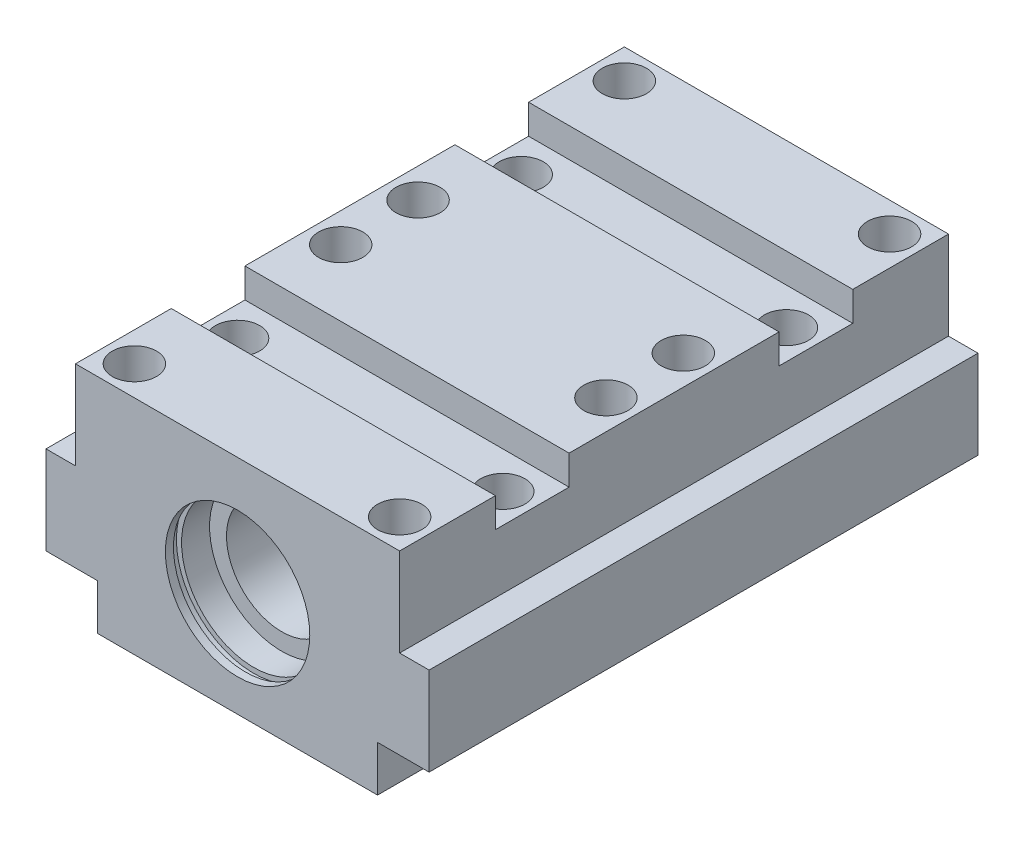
ISO-10303-21;
HEADER;
FILE_DESCRIPTION(('STEP AP214'),'2;1');
FILE_NAME('part.step','',(''),(''),'','','');
FILE_SCHEMA(('AUTOMOTIVE_DESIGN { 1 0 10303 214 1 1 1 1 }'));
ENDSEC;
DATA;
#1=APPLICATION_CONTEXT('core data for automotive mechanical design processes');
#2=APPLICATION_PROTOCOL_DEFINITION('international standard','automotive_design',2000,#1);
#3=PRODUCT_CONTEXT('',#1,'mechanical');
#4=PRODUCT('Part','Part','',(#3));
#5=PRODUCT_RELATED_PRODUCT_CATEGORY('part','',(#4));
#6=PRODUCT_DEFINITION_FORMATION('','',#4);
#7=PRODUCT_DEFINITION_CONTEXT('part definition',#1,'design');
#8=PRODUCT_DEFINITION('design','',#6,#7);
#9=PRODUCT_DEFINITION_SHAPE('','',#8);
#10=(LENGTH_UNIT() NAMED_UNIT(*) SI_UNIT(.MILLI.,.METRE.));
#11=(NAMED_UNIT(*) PLANE_ANGLE_UNIT() SI_UNIT($,.RADIAN.));
#12=(NAMED_UNIT(*) SI_UNIT($,.STERADIAN.) SOLID_ANGLE_UNIT());
#13=UNCERTAINTY_MEASURE_WITH_UNIT(LENGTH_MEASURE(1.E-05),#10,'distance_accuracy_value','');
#14=(GEOMETRIC_REPRESENTATION_CONTEXT(3) GLOBAL_UNCERTAINTY_ASSIGNED_CONTEXT((#13)) GLOBAL_UNIT_ASSIGNED_CONTEXT((#10,
#11,#12)) REPRESENTATION_CONTEXT('',''));
#15=CARTESIAN_POINT('',(0.,0.,0.));
#16=DIRECTION('',(0.,0.,1.));
#17=DIRECTION('',(1.,0.,0.));
#18=AXIS2_PLACEMENT_3D('',#15,#16,#17);
#19=CARTESIAN_POINT('',(0.,-4.,0.));
#20=DIRECTION('',(0.,-1.,0.));
#21=DIRECTION('',(0.,0.,-1.));
#22=AXIS2_PLACEMENT_3D('',#19,#20,#21);
#23=PLANE('',#22);
#24=CARTESIAN_POINT('',(-18.,-4.,-19.25));
#25=DIRECTION('',(0.,-1.,0.));
#26=DIRECTION('',(0.,0.,-1.));
#27=AXIS2_PLACEMENT_3D('',#24,#25,#26);
#28=CIRCLE('',#27,3.);
#29=CARTESIAN_POINT('',(-18.,-4.,-22.25));
#30=VERTEX_POINT('',#29);
#31=EDGE_CURVE('E21',#30,#30,#28,.F.);
#32=ORIENTED_EDGE('',*,*,#31,.F.);
#33=EDGE_LOOP('',(#32));
#34=FACE_BOUND('',#33,.T.);
#35=CARTESIAN_POINT('',(18.,-4.,-19.25));
#36=DIRECTION('',(0.,-1.,0.));
#37=DIRECTION('',(0.,0.,-1.));
#38=AXIS2_PLACEMENT_3D('',#35,#36,#37);
#39=CIRCLE('',#38,3.);
#40=CARTESIAN_POINT('',(18.,-4.,-22.25));
#41=VERTEX_POINT('',#40);
#42=EDGE_CURVE('E370',#41,#41,#39,.F.);
#43=ORIENTED_EDGE('',*,*,#42,.F.);
#44=EDGE_LOOP('',(#43));
#45=FACE_BOUND('',#44,.T.);
#46=DIRECTION('',(0.,0.,1.));
#47=VECTOR('',#46,1.);
#48=CARTESIAN_POINT('',(22.,-4.,37.25));
#49=LINE('',#48,#47);
#50=CARTESIAN_POINT('',(22.,-4.,-14.25));
#51=VERTEX_POINT('',#50);
#52=CARTESIAN_POINT('',(22.,-4.,-24.25));
#53=VERTEX_POINT('',#52);
#54=EDGE_CURVE('E430',#51,#53,#49,.F.);
#55=ORIENTED_EDGE('',*,*,#54,.T.);
#56=DIRECTION('',(1.,0.,0.));
#57=VECTOR('',#56,1.);
#58=CARTESIAN_POINT('',(0.,-4.,-24.25));
#59=LINE('',#58,#57);
#60=CARTESIAN_POINT('',(-22.,-4.,-24.25));
#61=VERTEX_POINT('',#60);
#62=EDGE_CURVE('E443',#61,#53,#59,.T.);
#63=ORIENTED_EDGE('',*,*,#62,.F.);
#64=DIRECTION('',(0.,0.,-1.));
#65=VECTOR('',#64,1.);
#66=CARTESIAN_POINT('',(-22.,-4.,37.25));
#67=LINE('',#66,#65);
#68=CARTESIAN_POINT('',(-22.,-4.,-14.25));
#69=VERTEX_POINT('',#68);
#70=EDGE_CURVE('E439',#61,#69,#67,.F.);
#71=ORIENTED_EDGE('',*,*,#70,.T.);
#72=DIRECTION('',(1.,0.,0.));
#73=VECTOR('',#72,1.);
#74=CARTESIAN_POINT('',(0.,-4.,-14.25));
#75=LINE('',#74,#73);
#76=EDGE_CURVE('E445',#51,#69,#75,.F.);
#77=ORIENTED_EDGE('',*,*,#76,.F.);
#78=EDGE_LOOP('',(#55,#63,#71,#77));
#79=FACE_BOUND('',#78,.T.);
#80=ADVANCED_FACE('F17',(#34,#45,#79),#23,.F.);
#81=CARTESIAN_POINT('',(-22.,0.,37.25));
#82=DIRECTION('',(0.,-1.,0.));
#83=DIRECTION('',(1.,0.,0.));
#84=AXIS2_PLACEMENT_3D('',#81,#82,#83);
#85=PLANE('',#84);
#86=CARTESIAN_POINT('',(-18.,0.,-5.25));
#87=DIRECTION('',(0.,1.,0.));
#88=DIRECTION('',(-1.,0.,0.));
#89=AXIS2_PLACEMENT_3D('',#86,#87,#88);
#90=CIRCLE('',#89,3.);
#91=CARTESIAN_POINT('',(-21.,0.,-5.25));
#92=VERTEX_POINT('',#91);
#93=EDGE_CURVE('E1330',#92,#92,#90,.T.);
#94=ORIENTED_EDGE('',*,*,#93,.F.);
#95=EDGE_LOOP('',(#94));
#96=FACE_BOUND('',#95,.T.);
#97=CARTESIAN_POINT('',(18.,0.,-5.25));
#98=DIRECTION('',(0.,1.,0.));
#99=DIRECTION('',(-1.,0.,0.));
#100=AXIS2_PLACEMENT_3D('',#97,#98,#99);
#101=CIRCLE('',#100,3.);
#102=CARTESIAN_POINT('',(15.,0.,-5.25));
#103=VERTEX_POINT('',#102);
#104=EDGE_CURVE('E1324',#103,#103,#101,.T.);
#105=ORIENTED_EDGE('',*,*,#104,.F.);
#106=EDGE_LOOP('',(#105));
#107=FACE_BOUND('',#106,.T.);
#108=CARTESIAN_POINT('',(18.,0.,5.25));
#109=DIRECTION('',(0.,1.,0.));
#110=DIRECTION('',(-1.,0.,0.));
#111=AXIS2_PLACEMENT_3D('',#108,#109,#110);
#112=CIRCLE('',#111,3.);
#113=CARTESIAN_POINT('',(15.,0.,5.25));
#114=VERTEX_POINT('',#113);
#115=EDGE_CURVE('E1318',#114,#114,#112,.T.);
#116=ORIENTED_EDGE('',*,*,#115,.F.);
#117=EDGE_LOOP('',(#116));
#118=FACE_BOUND('',#117,.T.);
#119=CARTESIAN_POINT('',(-18.,0.,5.25));
#120=DIRECTION('',(0.,1.,0.));
#121=DIRECTION('',(-1.,0.,0.));
#122=AXIS2_PLACEMENT_3D('',#119,#120,#121);
#123=CIRCLE('',#122,3.);
#124=CARTESIAN_POINT('',(-21.,0.,5.25));
#125=VERTEX_POINT('',#124);
#126=EDGE_CURVE('E1342',#125,#125,#123,.T.);
#127=ORIENTED_EDGE('',*,*,#126,.F.);
#128=EDGE_LOOP('',(#127));
#129=FACE_BOUND('',#128,.T.);
#130=DIRECTION('',(0.,0.,-1.));
#131=VECTOR('',#130,1.);
#132=CARTESIAN_POINT('',(22.,0.,37.25));
#133=LINE('',#132,#131);
#134=CARTESIAN_POINT('',(22.,0.,-14.25));
#135=VERTEX_POINT('',#134);
#136=CARTESIAN_POINT('',(22.,0.,14.25));
#137=VERTEX_POINT('',#136);
#138=EDGE_CURVE('E237',#135,#137,#133,.F.);
#139=ORIENTED_EDGE('',*,*,#138,.F.);
#140=DIRECTION('',(1.,0.,0.));
#141=VECTOR('',#140,1.);
#142=CARTESIAN_POINT('',(-22.,0.,-14.25));
#143=LINE('',#142,#141);
#144=CARTESIAN_POINT('',(-22.,0.,-14.25));
#145=VERTEX_POINT('',#144);
#146=EDGE_CURVE('E332',#135,#145,#143,.F.);
#147=ORIENTED_EDGE('',*,*,#146,.T.);
#148=DIRECTION('',(0.,0.,-1.));
#149=VECTOR('',#148,1.);
#150=CARTESIAN_POINT('',(-22.,0.,37.25));
#151=LINE('',#150,#149);
#152=CARTESIAN_POINT('',(-22.,0.,14.25));
#153=VERTEX_POINT('',#152);
#154=EDGE_CURVE('E507',#145,#153,#151,.F.);
#155=ORIENTED_EDGE('',*,*,#154,.T.);
#156=DIRECTION('',(1.,0.,0.));
#157=VECTOR('',#156,1.);
#158=CARTESIAN_POINT('',(-22.,0.,14.25));
#159=LINE('',#158,#157);
#160=EDGE_CURVE('E335',#137,#153,#159,.F.);
#161=ORIENTED_EDGE('',*,*,#160,.F.);
#162=EDGE_LOOP('',(#139,#147,#155,#161));
#163=FACE_BOUND('',#162,.T.);
#164=ADVANCED_FACE('F595',(#96,#107,#118,#129,#163),#85,.F.);
#165=CARTESIAN_POINT('',(-22.,0.,37.25));
#166=DIRECTION('',(0.,-1.,0.));
#167=DIRECTION('',(1.,0.,0.));
#168=AXIS2_PLACEMENT_3D('',#165,#166,#167);
#169=PLANE('',#168);
#170=CARTESIAN_POINT('',(-18.,0.,33.25));
#171=DIRECTION('',(0.,1.,0.));
#172=DIRECTION('',(-1.,0.,0.));
#173=AXIS2_PLACEMENT_3D('',#170,#171,#172);
#174=CIRCLE('',#173,3.);
#175=CARTESIAN_POINT('',(-21.,0.,33.25));
#176=VERTEX_POINT('',#175);
#177=EDGE_CURVE('E1291',#176,#176,#174,.T.);
#178=ORIENTED_EDGE('',*,*,#177,.F.);
#179=EDGE_LOOP('',(#178));
#180=FACE_BOUND('',#179,.T.);
#181=CARTESIAN_POINT('',(18.,0.,33.25));
#182=DIRECTION('',(0.,1.,0.));
#183=DIRECTION('',(-1.,0.,0.));
#184=AXIS2_PLACEMENT_3D('',#181,#182,#183);
#185=CIRCLE('',#184,3.);
#186=CARTESIAN_POINT('',(15.,0.,33.25));
#187=VERTEX_POINT('',#186);
#188=EDGE_CURVE('E1289',#187,#187,#185,.T.);
#189=ORIENTED_EDGE('',*,*,#188,.F.);
#190=EDGE_LOOP('',(#189));
#191=FACE_BOUND('',#190,.T.);
#192=DIRECTION('',(0.,0.,1.));
#193=VECTOR('',#192,1.);
#194=CARTESIAN_POINT('',(22.,0.,37.25));
#195=LINE('',#194,#193);
#196=CARTESIAN_POINT('',(22.,0.,37.25));
#197=VERTEX_POINT('',#196);
#198=CARTESIAN_POINT('',(22.,0.,24.25));
#199=VERTEX_POINT('',#198);
#200=EDGE_CURVE('E513',#197,#199,#195,.F.);
#201=ORIENTED_EDGE('',*,*,#200,.T.);
#202=DIRECTION('',(1.,0.,0.));
#203=VECTOR('',#202,1.);
#204=CARTESIAN_POINT('',(-22.,0.,24.25));
#205=LINE('',#204,#203);
#206=CARTESIAN_POINT('',(-22.,0.,24.25));
#207=VERTEX_POINT('',#206);
#208=EDGE_CURVE('E337',#199,#207,#205,.F.);
#209=ORIENTED_EDGE('',*,*,#208,.T.);
#210=DIRECTION('',(0.,0.,-1.));
#211=VECTOR('',#210,1.);
#212=CARTESIAN_POINT('',(-22.,0.,37.25));
#213=LINE('',#212,#211);
#214=CARTESIAN_POINT('',(-22.,0.,37.25));
#215=VERTEX_POINT('',#214);
#216=EDGE_CURVE('E504',#207,#215,#213,.F.);
#217=ORIENTED_EDGE('',*,*,#216,.T.);
#218=DIRECTION('',(1.,0.,0.));
#219=VECTOR('',#218,1.);
#220=CARTESIAN_POINT('',(-22.,0.,37.25));
#221=LINE('',#220,#219);
#222=EDGE_CURVE('E312',#197,#215,#221,.F.);
#223=ORIENTED_EDGE('',*,*,#222,.F.);
#224=EDGE_LOOP('',(#201,#209,#217,#223));
#225=FACE_BOUND('',#224,.T.);
#226=ADVANCED_FACE('F612',(#180,#191,#225),#169,.F.);
#227=CARTESIAN_POINT('',(-22.,0.,37.25));
#228=DIRECTION('',(0.,-1.,0.));
#229=DIRECTION('',(1.,0.,0.));
#230=AXIS2_PLACEMENT_3D('',#227,#228,#229);
#231=PLANE('',#230);
#232=CARTESIAN_POINT('',(18.,0.,-33.25));
#233=DIRECTION('',(0.,1.,0.));
#234=DIRECTION('',(-1.,0.,0.));
#235=AXIS2_PLACEMENT_3D('',#232,#233,#234);
#236=CIRCLE('',#235,3.);
#237=CARTESIAN_POINT('',(15.,0.,-33.25));
#238=VERTEX_POINT('',#237);
#239=EDGE_CURVE('E1307',#238,#238,#236,.T.);
#240=ORIENTED_EDGE('',*,*,#239,.F.);
#241=EDGE_LOOP('',(#240));
#242=FACE_BOUND('',#241,.T.);
#243=CARTESIAN_POINT('',(-18.,0.,-33.25));
#244=DIRECTION('',(0.,1.,0.));
#245=DIRECTION('',(-1.,0.,0.));
#246=AXIS2_PLACEMENT_3D('',#243,#244,#245);
#247=CIRCLE('',#246,3.);
#248=CARTESIAN_POINT('',(-21.,0.,-33.25));
#249=VERTEX_POINT('',#248);
#250=EDGE_CURVE('E1313',#249,#249,#247,.T.);
#251=ORIENTED_EDGE('',*,*,#250,.F.);
#252=EDGE_LOOP('',(#251));
#253=FACE_BOUND('',#252,.T.);
#254=DIRECTION('',(0.,0.,-1.));
#255=VECTOR('',#254,1.);
#256=CARTESIAN_POINT('',(22.,0.,37.25));
#257=LINE('',#256,#255);
#258=CARTESIAN_POINT('',(22.,0.,-37.25));
#259=VERTEX_POINT('',#258);
#260=CARTESIAN_POINT('',(22.,0.,-24.25));
#261=VERTEX_POINT('',#260);
#262=EDGE_CURVE('E486',#259,#261,#257,.F.);
#263=ORIENTED_EDGE('',*,*,#262,.F.);
#264=DIRECTION('',(1.,0.,0.));
#265=VECTOR('',#264,1.);
#266=CARTESIAN_POINT('',(-22.,0.,-37.25));
#267=LINE('',#266,#265);
#268=CARTESIAN_POINT('',(-22.,0.,-37.25));
#269=VERTEX_POINT('',#268);
#270=EDGE_CURVE('E326',#269,#259,#267,.T.);
#271=ORIENTED_EDGE('',*,*,#270,.F.);
#272=DIRECTION('',(0.,0.,-1.));
#273=VECTOR('',#272,1.);
#274=CARTESIAN_POINT('',(-22.,0.,37.25));
#275=LINE('',#274,#273);
#276=CARTESIAN_POINT('',(-22.,0.,-24.25));
#277=VERTEX_POINT('',#276);
#278=EDGE_CURVE('E510',#269,#277,#275,.F.);
#279=ORIENTED_EDGE('',*,*,#278,.T.);
#280=DIRECTION('',(-1.,0.,0.));
#281=VECTOR('',#280,1.);
#282=CARTESIAN_POINT('',(-22.,0.,-24.25));
#283=LINE('',#282,#281);
#284=EDGE_CURVE('E329',#277,#261,#283,.F.);
#285=ORIENTED_EDGE('',*,*,#284,.T.);
#286=EDGE_LOOP('',(#263,#271,#279,#285));
#287=FACE_BOUND('',#286,.T.);
#288=ADVANCED_FACE('F580',(#242,#253,#287),#231,.F.);
#289=CARTESIAN_POINT('',(0.,0.,37.25));
#290=DIRECTION('',(0.,0.,-1.));
#291=DIRECTION('',(-1.,0.,0.));
#292=AXIS2_PLACEMENT_3D('',#289,#290,#291);
#293=PLANE('',#292);
#294=DIRECTION('',(0.,1.,0.));
#295=VECTOR('',#294,1.);
#296=CARTESIAN_POINT('',(19.,0.,37.25));
#297=LINE('',#296,#295);
#298=CARTESIAN_POINT('',(19.,-24.,37.25));
#299=VERTEX_POINT('',#298);
#300=CARTESIAN_POINT('',(19.,-30.2,37.25));
#301=VERTEX_POINT('',#300);
#302=EDGE_CURVE('E246',#299,#301,#297,.F.);
#303=ORIENTED_EDGE('',*,*,#302,.F.);
#304=DIRECTION('',(-1.,0.,0.));
#305=VECTOR('',#304,1.);
#306=CARTESIAN_POINT('',(26.,-24.,37.25));
#307=LINE('',#306,#305);
#308=CARTESIAN_POINT('',(26.,-24.,37.25));
#309=VERTEX_POINT('',#308);
#310=EDGE_CURVE('E283',#299,#309,#307,.F.);
#311=ORIENTED_EDGE('',*,*,#310,.T.);
#312=DIRECTION('',(0.,1.,0.));
#313=VECTOR('',#312,1.);
#314=CARTESIAN_POINT('',(26.,0.,37.25));
#315=LINE('',#314,#313);
#316=CARTESIAN_POINT('',(26.,-12.,37.25));
#317=VERTEX_POINT('',#316);
#318=EDGE_CURVE('E260',#317,#309,#315,.F.);
#319=ORIENTED_EDGE('',*,*,#318,.F.);
#320=DIRECTION('',(-1.,0.,0.));
#321=VECTOR('',#320,1.);
#322=CARTESIAN_POINT('',(0.,-12.,37.25));
#323=LINE('',#322,#321);
#324=CARTESIAN_POINT('',(22.,-12.,37.25));
#325=VERTEX_POINT('',#324);
#326=EDGE_CURVE('E280',#325,#317,#323,.F.);
#327=ORIENTED_EDGE('',*,*,#326,.F.);
#328=DIRECTION('',(0.,-1.,0.));
#329=VECTOR('',#328,1.);
#330=CARTESIAN_POINT('',(22.,0.,37.25));
#331=LINE('',#330,#329);
#332=EDGE_CURVE('E263',#325,#197,#331,.F.);
#333=ORIENTED_EDGE('',*,*,#332,.T.);
#334=ORIENTED_EDGE('',*,*,#222,.T.);
#335=DIRECTION('',(0.,-1.,0.));
#336=VECTOR('',#335,1.);
#337=CARTESIAN_POINT('',(-22.,0.,37.25));
#338=LINE('',#337,#336);
#339=CARTESIAN_POINT('',(-22.,-12.,37.25));
#340=VERTEX_POINT('',#339);
#341=EDGE_CURVE('E270',#340,#215,#338,.F.);
#342=ORIENTED_EDGE('',*,*,#341,.F.);
#343=DIRECTION('',(1.,0.,0.));
#344=VECTOR('',#343,1.);
#345=CARTESIAN_POINT('',(-26.,-12.,37.25));
#346=LINE('',#345,#344);
#347=CARTESIAN_POINT('',(-26.,-12.,37.25));
#348=VERTEX_POINT('',#347);
#349=EDGE_CURVE('E289',#340,#348,#346,.F.);
#350=ORIENTED_EDGE('',*,*,#349,.T.);
#351=DIRECTION('',(0.,1.,0.));
#352=VECTOR('',#351,1.);
#353=CARTESIAN_POINT('',(-26.,-24.,37.25));
#354=LINE('',#353,#352);
#355=CARTESIAN_POINT('',(-26.,-24.,37.25));
#356=VERTEX_POINT('',#355);
#357=EDGE_CURVE('E268',#348,#356,#354,.F.);
#358=ORIENTED_EDGE('',*,*,#357,.T.);
#359=DIRECTION('',(1.,0.,0.));
#360=VECTOR('',#359,1.);
#361=CARTESIAN_POINT('',(0.,-24.,37.25));
#362=LINE('',#361,#360);
#363=CARTESIAN_POINT('',(-19.,-24.,37.25));
#364=VERTEX_POINT('',#363);
#365=EDGE_CURVE('E286',#364,#356,#362,.F.);
#366=ORIENTED_EDGE('',*,*,#365,.F.);
#367=DIRECTION('',(0.,1.,0.));
#368=VECTOR('',#367,1.);
#369=CARTESIAN_POINT('',(-19.,-30.2,37.25));
#370=LINE('',#369,#368);
#371=CARTESIAN_POINT('',(-19.,-30.2,37.25));
#372=VERTEX_POINT('',#371);
#373=EDGE_CURVE('E266',#364,#372,#370,.F.);
#374=ORIENTED_EDGE('',*,*,#373,.T.);
#375=DIRECTION('',(1.,0.,0.));
#376=VECTOR('',#375,1.);
#377=CARTESIAN_POINT('',(0.,-30.2,37.25));
#378=LINE('',#377,#376);
#379=EDGE_CURVE('E278',#301,#372,#378,.F.);
#380=ORIENTED_EDGE('',*,*,#379,.F.);
#381=EDGE_LOOP('',(#303,#311,#319,#327,#333,#334,#342,#350,#358,#366,#374,#380));
#382=FACE_BOUND('',#381,.T.);
#383=CARTESIAN_POINT('',(0.,-16.,37.25));
#384=DIRECTION('',(0.,0.,-1.));
#385=DIRECTION('',(-1.,0.,0.));
#386=AXIS2_PLACEMENT_3D('',#383,#384,#385);
#387=CIRCLE('',#386,9.8);
#388=CARTESIAN_POINT('',(-9.8,-16.,37.25));
#389=VERTEX_POINT('',#388);
#390=EDGE_CURVE('E26',#389,#389,#387,.T.);
#391=ORIENTED_EDGE('',*,*,#390,.T.);
#392=EDGE_LOOP('',(#391));
#393=FACE_BOUND('',#392,.T.);
#394=ADVANCED_FACE('F546',(#382,#393),#293,.F.);
#395=CARTESIAN_POINT('',(19.,-30.2,37.25));
#396=DIRECTION('',(0.,1.,0.));
#397=DIRECTION('',(0.,0.,1.));
#398=AXIS2_PLACEMENT_3D('',#395,#396,#397);
#399=PLANE('',#398);
#400=DIRECTION('',(0.,0.,1.));
#401=VECTOR('',#400,1.);
#402=CARTESIAN_POINT('',(15.,-30.2,37.25));
#403=LINE('',#402,#401);
#404=CARTESIAN_POINT('',(15.,-30.2,-16.25));
#405=VERTEX_POINT('',#404);
#406=CARTESIAN_POINT('',(15.,-30.2,3.75));
#407=VERTEX_POINT('',#406);
#408=EDGE_CURVE('E361',#405,#407,#403,.T.);
#409=ORIENTED_EDGE('',*,*,#408,.F.);
#410=CARTESIAN_POINT('',(12.,-30.2,-16.25));
#411=DIRECTION('',(0.,1.,0.));
#412=DIRECTION('',(0.,0.,1.));
#413=AXIS2_PLACEMENT_3D('',#410,#411,#412);
#414=CIRCLE('',#413,3.);
#415=CARTESIAN_POINT('',(9.,-30.2,-16.25));
#416=VERTEX_POINT('',#415);
#417=EDGE_CURVE('E363',#405,#416,#414,.T.);
#418=ORIENTED_EDGE('',*,*,#417,.T.);
#419=DIRECTION('',(0.,0.,-1.));
#420=VECTOR('',#419,1.);
#421=CARTESIAN_POINT('',(9.,-30.2,37.25));
#422=LINE('',#421,#420);
#423=CARTESIAN_POINT('',(9.,-30.2,3.75000000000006));
#424=VERTEX_POINT('',#423);
#425=EDGE_CURVE('E342',#424,#416,#422,.T.);
#426=ORIENTED_EDGE('',*,*,#425,.F.);
#427=CARTESIAN_POINT('',(12.,-30.2,3.75));
#428=DIRECTION('',(0.,1.,0.));
#429=DIRECTION('',(0.,0.,1.));
#430=AXIS2_PLACEMENT_3D('',#427,#428,#429);
#431=CIRCLE('',#430,3.);
#432=EDGE_CURVE('E359',#424,#407,#431,.T.);
#433=ORIENTED_EDGE('',*,*,#432,.T.);
#434=EDGE_LOOP('',(#409,#418,#426,#433));
#435=FACE_BOUND('',#434,.T.);
#436=DIRECTION('',(1.,0.,0.));
#437=VECTOR('',#436,1.);
#438=CARTESIAN_POINT('',(19.,-30.2,-24.05));
#439=LINE('',#438,#437);
#440=CARTESIAN_POINT('',(19.,-30.2,-24.05));
#441=VERTEX_POINT('',#440);
#442=CARTESIAN_POINT('',(-19.,-30.2,-24.05));
#443=VERTEX_POINT('',#442);
#444=EDGE_CURVE('E224',#441,#443,#439,.F.);
#445=ORIENTED_EDGE('',*,*,#444,.F.);
#446=DIRECTION('',(0.,0.,-1.));
#447=VECTOR('',#446,1.);
#448=CARTESIAN_POINT('',(19.,-30.2,37.25));
#449=LINE('',#448,#447);
#450=EDGE_CURVE('E229',#441,#301,#449,.F.);
#451=ORIENTED_EDGE('',*,*,#450,.T.);
#452=ORIENTED_EDGE('',*,*,#379,.T.);
#453=DIRECTION('',(0.,0.,1.));
#454=VECTOR('',#453,1.);
#455=CARTESIAN_POINT('',(-19.,-30.2,37.25));
#456=LINE('',#455,#454);
#457=EDGE_CURVE('E232',#372,#443,#456,.F.);
#458=ORIENTED_EDGE('',*,*,#457,.T.);
#459=EDGE_LOOP('',(#445,#451,#452,#458));
#460=FACE_BOUND('',#459,.T.);
#461=CARTESIAN_POINT('',(-12.,-30.2,-16.25));
#462=DIRECTION('',(0.,1.,0.));
#463=DIRECTION('',(0.,0.,1.));
#464=AXIS2_PLACEMENT_3D('',#461,#462,#463);
#465=CIRCLE('',#464,3.);
#466=CARTESIAN_POINT('',(-15.,-30.2,-16.25));
#467=VERTEX_POINT('',#466);
#468=CARTESIAN_POINT('',(-9.,-30.2,-16.25));
#469=VERTEX_POINT('',#468);
#470=EDGE_CURVE('E353',#467,#469,#465,.F.);
#471=ORIENTED_EDGE('',*,*,#470,.F.);
#472=DIRECTION('',(0.,0.,1.));
#473=VECTOR('',#472,1.);
#474=CARTESIAN_POINT('',(-15.,-30.2,3.75000000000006));
#475=LINE('',#474,#473);
#476=CARTESIAN_POINT('',(-15.,-30.2,3.75000000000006));
#477=VERTEX_POINT('',#476);
#478=EDGE_CURVE('E343',#467,#477,#475,.T.);
#479=ORIENTED_EDGE('',*,*,#478,.T.);
#480=CARTESIAN_POINT('',(-12.,-30.2,3.75));
#481=DIRECTION('',(0.,1.,0.));
#482=DIRECTION('',(0.,0.,1.));
#483=AXIS2_PLACEMENT_3D('',#480,#481,#482);
#484=CIRCLE('',#483,3.);
#485=CARTESIAN_POINT('',(-9.,-30.2,3.75));
#486=VERTEX_POINT('',#485);
#487=EDGE_CURVE('E347',#486,#477,#484,.F.);
#488=ORIENTED_EDGE('',*,*,#487,.F.);
#489=DIRECTION('',(0.,0.,-1.));
#490=VECTOR('',#489,1.);
#491=CARTESIAN_POINT('',(-9.,-30.2,3.75));
#492=LINE('',#491,#490);
#493=EDGE_CURVE('E350',#486,#469,#492,.T.);
#494=ORIENTED_EDGE('',*,*,#493,.T.);
#495=EDGE_LOOP('',(#471,#479,#488,#494));
#496=FACE_BOUND('',#495,.T.);
#497=ADVANCED_FACE('F226',(#435,#460,#496),#399,.F.);
#498=CARTESIAN_POINT('',(-12.,-22.2,3.75));
#499=DIRECTION('',(0.,1.,0.));
#500=DIRECTION('',(0.,0.,1.));
#501=AXIS2_PLACEMENT_3D('',#498,#499,#500);
#502=PLANE('',#501);
#503=DIRECTION('',(0.,0.,-1.));
#504=VECTOR('',#503,1.);
#505=CARTESIAN_POINT('',(-15.,-22.2,3.75000000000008));
#506=LINE('',#505,#504);
#507=CARTESIAN_POINT('',(-15.,-22.2,-16.25));
#508=VERTEX_POINT('',#507);
#509=CARTESIAN_POINT('',(-15.,-22.2,3.75000000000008));
#510=VERTEX_POINT('',#509);
#511=EDGE_CURVE('E413',#508,#510,#506,.F.);
#512=ORIENTED_EDGE('',*,*,#511,.F.);
#513=CARTESIAN_POINT('',(-12.,-22.2,-16.25));
#514=DIRECTION('',(0.,-1.,0.));
#515=DIRECTION('',(0.,0.,-1.));
#516=AXIS2_PLACEMENT_3D('',#513,#514,#515);
#517=CIRCLE('',#516,3.);
#518=CARTESIAN_POINT('',(-9.,-22.2,-16.25));
#519=VERTEX_POINT('',#518);
#520=EDGE_CURVE('E409',#508,#519,#517,.T.);
#521=ORIENTED_EDGE('',*,*,#520,.T.);
#522=DIRECTION('',(0.,0.,1.));
#523=VECTOR('',#522,1.);
#524=CARTESIAN_POINT('',(-9.,-22.2,3.75));
#525=LINE('',#524,#523);
#526=CARTESIAN_POINT('',(-9.,-22.2,3.75));
#527=VERTEX_POINT('',#526);
#528=EDGE_CURVE('E424',#527,#519,#525,.F.);
#529=ORIENTED_EDGE('',*,*,#528,.F.);
#530=CARTESIAN_POINT('',(-12.,-22.2,3.75));
#531=DIRECTION('',(0.,-1.,0.));
#532=DIRECTION('',(0.,0.,-1.));
#533=AXIS2_PLACEMENT_3D('',#530,#531,#532);
#534=CIRCLE('',#533,3.);
#535=EDGE_CURVE('E419',#527,#510,#534,.T.);
#536=ORIENTED_EDGE('',*,*,#535,.T.);
#537=EDGE_LOOP('',(#512,#521,#529,#536));
#538=FACE_BOUND('',#537,.T.);
#539=ADVANCED_FACE('F719',(#538),#502,.F.);
#540=CARTESIAN_POINT('',(-12.,-22.2,3.75));
#541=DIRECTION('',(0.,-1.,0.));
#542=DIRECTION('',(0.,0.,-1.));
#543=AXIS2_PLACEMENT_3D('',#540,#541,#542);
#544=CYLINDRICAL_SURFACE('',#543,3.);
#545=DIRECTION('',(0.,-1.,0.));
#546=VECTOR('',#545,1.);
#547=CARTESIAN_POINT('',(-9.,-22.2,3.75));
#548=LINE('',#547,#546);
#549=EDGE_CURVE('E416',#486,#527,#548,.F.);
#550=ORIENTED_EDGE('',*,*,#549,.F.);
#551=ORIENTED_EDGE('',*,*,#487,.T.);
#552=DIRECTION('',(0.,1.,0.));
#553=VECTOR('',#552,1.);
#554=CARTESIAN_POINT('',(-15.,-22.2,3.75000000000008));
#555=LINE('',#554,#553);
#556=EDGE_CURVE('E414',#510,#477,#555,.F.);
#557=ORIENTED_EDGE('',*,*,#556,.F.);
#558=ORIENTED_EDGE('',*,*,#535,.F.);
#559=EDGE_LOOP('',(#550,#551,#557,#558));
#560=FACE_BOUND('',#559,.T.);
#561=ADVANCED_FACE('F715',(#560),#544,.F.);
#562=CARTESIAN_POINT('',(-15.,-22.2,3.75000000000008));
#563=DIRECTION('',(1.,0.,0.));
#564=DIRECTION('',(0.,0.,-1.));
#565=AXIS2_PLACEMENT_3D('',#562,#563,#564);
#566=PLANE('',#565);
#567=DIRECTION('',(0.,-1.,0.));
#568=VECTOR('',#567,1.);
#569=CARTESIAN_POINT('',(-15.,-22.2,-16.25));
#570=LINE('',#569,#568);
#571=EDGE_CURVE('E410',#467,#508,#570,.F.);
#572=ORIENTED_EDGE('',*,*,#571,.T.);
#573=ORIENTED_EDGE('',*,*,#511,.T.);
#574=ORIENTED_EDGE('',*,*,#556,.T.);
#575=ORIENTED_EDGE('',*,*,#478,.F.);
#576=EDGE_LOOP('',(#572,#573,#574,#575));
#577=FACE_BOUND('',#576,.T.);
#578=ADVANCED_FACE('F711',(#577),#566,.T.);
#579=CARTESIAN_POINT('',(-12.,-22.2,-16.25));
#580=DIRECTION('',(0.,-1.,0.));
#581=DIRECTION('',(0.,0.,-1.));
#582=AXIS2_PLACEMENT_3D('',#579,#580,#581);
#583=CYLINDRICAL_SURFACE('',#582,3.);
#584=ORIENTED_EDGE('',*,*,#520,.F.);
#585=ORIENTED_EDGE('',*,*,#571,.F.);
#586=ORIENTED_EDGE('',*,*,#470,.T.);
#587=DIRECTION('',(0.,-1.,0.));
#588=VECTOR('',#587,1.);
#589=CARTESIAN_POINT('',(-9.,-22.2,-16.25));
#590=LINE('',#589,#588);
#591=EDGE_CURVE('E407',#519,#469,#590,.T.);
#592=ORIENTED_EDGE('',*,*,#591,.F.);
#593=EDGE_LOOP('',(#584,#585,#586,#592));
#594=FACE_BOUND('',#593,.T.);
#595=ADVANCED_FACE('F714',(#594),#583,.F.);
#596=CARTESIAN_POINT('',(-9.,-22.2,3.75));
#597=DIRECTION('',(-1.,0.,0.));
#598=DIRECTION('',(0.,0.,1.));
#599=AXIS2_PLACEMENT_3D('',#596,#597,#598);
#600=PLANE('',#599);
#601=ORIENTED_EDGE('',*,*,#549,.T.);
#602=ORIENTED_EDGE('',*,*,#528,.T.);
#603=ORIENTED_EDGE('',*,*,#591,.T.);
#604=ORIENTED_EDGE('',*,*,#493,.F.);
#605=EDGE_LOOP('',(#601,#602,#603,#604));
#606=FACE_BOUND('',#605,.T.);
#607=ADVANCED_FACE('F659',(#606),#600,.T.);
#608=CARTESIAN_POINT('',(-22.,-4.,24.25));
#609=DIRECTION('',(0.,0.,1.));
#610=DIRECTION('',(1.,0.,0.));
#611=AXIS2_PLACEMENT_3D('',#608,#609,#610);
#612=PLANE('',#611);
#613=DIRECTION('',(0.,-1.,0.));
#614=VECTOR('',#613,1.);
#615=CARTESIAN_POINT('',(22.,-4.,24.25));
#616=LINE('',#615,#614);
#617=CARTESIAN_POINT('',(22.,-4.,24.25));
#618=VERTEX_POINT('',#617);
#619=EDGE_CURVE('E295',#618,#199,#616,.F.);
#620=ORIENTED_EDGE('',*,*,#619,.F.);
#621=DIRECTION('',(1.,0.,0.));
#622=VECTOR('',#621,1.);
#623=CARTESIAN_POINT('',(0.,-4.,24.25));
#624=LINE('',#623,#622);
#625=CARTESIAN_POINT('',(-22.,-4.,24.25));
#626=VERTEX_POINT('',#625);
#627=EDGE_CURVE('E447',#626,#618,#624,.T.);
#628=ORIENTED_EDGE('',*,*,#627,.F.);
#629=DIRECTION('',(0.,-1.,0.));
#630=VECTOR('',#629,1.);
#631=CARTESIAN_POINT('',(-22.,-12.,24.25));
#632=LINE('',#631,#630);
#633=EDGE_CURVE('E302',#626,#207,#632,.F.);
#634=ORIENTED_EDGE('',*,*,#633,.T.);
#635=ORIENTED_EDGE('',*,*,#208,.F.);
#636=EDGE_LOOP('',(#620,#628,#634,#635));
#637=FACE_BOUND('',#636,.T.);
#638=ADVANCED_FACE('F610',(#637),#612,.F.);
#639=CARTESIAN_POINT('',(-22.,-4.,14.25));
#640=DIRECTION('',(0.,0.,-1.));
#641=DIRECTION('',(-1.,0.,0.));
#642=AXIS2_PLACEMENT_3D('',#639,#640,#641);
#643=PLANE('',#642);
#644=DIRECTION('',(0.,-1.,0.));
#645=VECTOR('',#644,1.);
#646=CARTESIAN_POINT('',(-22.,-4.,14.25));
#647=LINE('',#646,#645);
#648=CARTESIAN_POINT('',(-22.,-4.,14.25));
#649=VERTEX_POINT('',#648);
#650=EDGE_CURVE('E305',#649,#153,#647,.F.);
#651=ORIENTED_EDGE('',*,*,#650,.F.);
#652=DIRECTION('',(1.,0.,0.));
#653=VECTOR('',#652,1.);
#654=CARTESIAN_POINT('',(0.,-4.,14.25));
#655=LINE('',#654,#653);
#656=CARTESIAN_POINT('',(22.,-4.,14.25));
#657=VERTEX_POINT('',#656);
#658=EDGE_CURVE('E449',#657,#649,#655,.F.);
#659=ORIENTED_EDGE('',*,*,#658,.F.);
#660=DIRECTION('',(0.,-1.,0.));
#661=VECTOR('',#660,1.);
#662=CARTESIAN_POINT('',(22.,0.,14.25));
#663=LINE('',#662,#661);
#664=EDGE_CURVE('E292',#657,#137,#663,.F.);
#665=ORIENTED_EDGE('',*,*,#664,.T.);
#666=ORIENTED_EDGE('',*,*,#160,.T.);
#667=EDGE_LOOP('',(#651,#659,#665,#666));
#668=FACE_BOUND('',#667,.T.);
#669=ADVANCED_FACE('F599',(#668),#643,.F.);
#670=CARTESIAN_POINT('',(-22.,-4.,-14.25));
#671=DIRECTION('',(0.,0.,1.));
#672=DIRECTION('',(1.,0.,0.));
#673=AXIS2_PLACEMENT_3D('',#670,#671,#672);
#674=PLANE('',#673);
#675=DIRECTION('',(0.,-1.,0.));
#676=VECTOR('',#675,1.);
#677=CARTESIAN_POINT('',(-22.,-12.,-14.25));
#678=LINE('',#677,#676);
#679=EDGE_CURVE('E308',#69,#145,#678,.F.);
#680=ORIENTED_EDGE('',*,*,#679,.T.);
#681=ORIENTED_EDGE('',*,*,#146,.F.);
#682=DIRECTION('',(0.,-1.,0.));
#683=VECTOR('',#682,1.);
#684=CARTESIAN_POINT('',(22.,-4.,-14.25));
#685=LINE('',#684,#683);
#686=EDGE_CURVE('E300',#51,#135,#685,.F.);
#687=ORIENTED_EDGE('',*,*,#686,.F.);
#688=ORIENTED_EDGE('',*,*,#76,.T.);
#689=EDGE_LOOP('',(#680,#681,#687,#688));
#690=FACE_BOUND('',#689,.T.);
#691=ADVANCED_FACE('F591',(#690),#674,.F.);
#692=CARTESIAN_POINT('',(-22.,-4.,-24.25));
#693=DIRECTION('',(0.,0.,-1.));
#694=DIRECTION('',(-1.,0.,0.));
#695=AXIS2_PLACEMENT_3D('',#692,#693,#694);
#696=PLANE('',#695);
#697=DIRECTION('',(0.,-1.,0.));
#698=VECTOR('',#697,1.);
#699=CARTESIAN_POINT('',(22.,0.,-24.25));
#700=LINE('',#699,#698);
#701=EDGE_CURVE('E298',#53,#261,#700,.F.);
#702=ORIENTED_EDGE('',*,*,#701,.T.);
#703=ORIENTED_EDGE('',*,*,#284,.F.);
#704=DIRECTION('',(0.,-1.,0.));
#705=VECTOR('',#704,1.);
#706=CARTESIAN_POINT('',(-22.,-4.,-24.25));
#707=LINE('',#706,#705);
#708=EDGE_CURVE('E310',#61,#277,#707,.F.);
#709=ORIENTED_EDGE('',*,*,#708,.F.);
#710=ORIENTED_EDGE('',*,*,#62,.T.);
#711=EDGE_LOOP('',(#702,#703,#709,#710));
#712=FACE_BOUND('',#711,.T.);
#713=ADVANCED_FACE('F584',(#712),#696,.F.);
#714=CARTESIAN_POINT('',(0.,-4.,0.));
#715=DIRECTION('',(0.,1.,0.));
#716=DIRECTION('',(0.,0.,1.));
#717=AXIS2_PLACEMENT_3D('',#714,#715,#716);
#718=PLANE('',#717);
#719=CARTESIAN_POINT('',(-18.,-4.,19.25));
#720=DIRECTION('',(0.,1.,0.));
#721=DIRECTION('',(-1.,0.,0.));
#722=AXIS2_PLACEMENT_3D('',#719,#720,#721);
#723=CIRCLE('',#722,3.);
#724=CARTESIAN_POINT('',(-21.,-4.,19.25));
#725=VERTEX_POINT('',#724);
#726=EDGE_CURVE('E1297',#725,#725,#723,.T.);
#727=ORIENTED_EDGE('',*,*,#726,.F.);
#728=EDGE_LOOP('',(#727));
#729=FACE_BOUND('',#728,.T.);
#730=CARTESIAN_POINT('',(18.,-4.,19.25));
#731=DIRECTION('',(0.,1.,0.));
#732=DIRECTION('',(-1.,0.,0.));
#733=AXIS2_PLACEMENT_3D('',#730,#731,#732);
#734=CIRCLE('',#733,3.);
#735=CARTESIAN_POINT('',(15.,-4.,19.25));
#736=VERTEX_POINT('',#735);
#737=EDGE_CURVE('E1294',#736,#736,#734,.T.);
#738=ORIENTED_EDGE('',*,*,#737,.F.);
#739=EDGE_LOOP('',(#738));
#740=FACE_BOUND('',#739,.T.);
#741=ORIENTED_EDGE('',*,*,#627,.T.);
#742=DIRECTION('',(0.,0.,1.));
#743=VECTOR('',#742,1.);
#744=CARTESIAN_POINT('',(22.,-4.,37.25));
#745=LINE('',#744,#743);
#746=EDGE_CURVE('E433',#618,#657,#745,.F.);
#747=ORIENTED_EDGE('',*,*,#746,.T.);
#748=ORIENTED_EDGE('',*,*,#658,.T.);
#749=DIRECTION('',(0.,0.,-1.));
#750=VECTOR('',#749,1.);
#751=CARTESIAN_POINT('',(-22.,-4.,37.25));
#752=LINE('',#751,#750);
#753=EDGE_CURVE('E437',#649,#626,#752,.F.);
#754=ORIENTED_EDGE('',*,*,#753,.T.);
#755=EDGE_LOOP('',(#741,#747,#748,#754));
#756=FACE_BOUND('',#755,.T.);
#757=ADVANCED_FACE('F606',(#729,#740,#756),#718,.T.);
#758=CARTESIAN_POINT('',(-26.,-12.,37.25));
#759=DIRECTION('',(0.,-1.,0.));
#760=DIRECTION('',(0.,0.,-1.));
#761=AXIS2_PLACEMENT_3D('',#758,#759,#760);
#762=PLANE('',#761);
#763=DIRECTION('',(0.,0.,-1.));
#764=VECTOR('',#763,1.);
#765=CARTESIAN_POINT('',(-22.,-12.,37.25));
#766=LINE('',#765,#764);
#767=CARTESIAN_POINT('',(-22.,-12.,-37.25));
#768=VERTEX_POINT('',#767);
#769=EDGE_CURVE('E435',#340,#768,#766,.T.);
#770=ORIENTED_EDGE('',*,*,#769,.T.);
#771=DIRECTION('',(-1.,0.,0.));
#772=VECTOR('',#771,1.);
#773=CARTESIAN_POINT('',(0.,-12.,-37.25));
#774=LINE('',#773,#772);
#775=CARTESIAN_POINT('',(-26.,-12.,-37.25));
#776=VERTEX_POINT('',#775);
#777=EDGE_CURVE('E323',#768,#776,#774,.T.);
#778=ORIENTED_EDGE('',*,*,#777,.T.);
#779=DIRECTION('',(0.,0.,1.));
#780=VECTOR('',#779,1.);
#781=CARTESIAN_POINT('',(-26.,-12.,37.25));
#782=LINE('',#781,#780);
#783=EDGE_CURVE('E502',#348,#776,#782,.F.);
#784=ORIENTED_EDGE('',*,*,#783,.F.);
#785=ORIENTED_EDGE('',*,*,#349,.F.);
#786=EDGE_LOOP('',(#770,#778,#784,#785));
#787=FACE_BOUND('',#786,.T.);
#788=ADVANCED_FACE('F572',(#787),#762,.F.);
#789=CARTESIAN_POINT('',(-22.,-12.,37.25));
#790=DIRECTION('',(1.,0.,0.));
#791=DIRECTION('',(0.,0.,-1.));
#792=AXIS2_PLACEMENT_3D('',#789,#790,#791);
#793=PLANE('',#792);
#794=ORIENTED_EDGE('',*,*,#679,.F.);
#795=ORIENTED_EDGE('',*,*,#70,.F.);
#796=ORIENTED_EDGE('',*,*,#708,.T.);
#797=ORIENTED_EDGE('',*,*,#278,.F.);
#798=DIRECTION('',(0.,1.,0.));
#799=VECTOR('',#798,1.);
#800=CARTESIAN_POINT('',(-22.,-12.,-37.25));
#801=LINE('',#800,#799);
#802=EDGE_CURVE('E520',#768,#269,#801,.T.);
#803=ORIENTED_EDGE('',*,*,#802,.F.);
#804=ORIENTED_EDGE('',*,*,#769,.F.);
#805=ORIENTED_EDGE('',*,*,#341,.T.);
#806=ORIENTED_EDGE('',*,*,#216,.F.);
#807=ORIENTED_EDGE('',*,*,#633,.F.);
#808=ORIENTED_EDGE('',*,*,#753,.F.);
#809=ORIENTED_EDGE('',*,*,#650,.T.);
#810=ORIENTED_EDGE('',*,*,#154,.F.);
#811=EDGE_LOOP('',(#794,#795,#796,#797,#803,#804,#805,#806,#807,#808,#809,#810));
#812=FACE_BOUND('',#811,.T.);
#813=ADVANCED_FACE('F577',(#812),#793,.F.);
#814=CARTESIAN_POINT('',(22.,0.,37.25));
#815=DIRECTION('',(-1.,0.,0.));
#816=DIRECTION('',(0.,0.,1.));
#817=AXIS2_PLACEMENT_3D('',#814,#815,#816);
#818=PLANE('',#817);
#819=ORIENTED_EDGE('',*,*,#664,.F.);
#820=ORIENTED_EDGE('',*,*,#746,.F.);
#821=ORIENTED_EDGE('',*,*,#619,.T.);
#822=ORIENTED_EDGE('',*,*,#200,.F.);
#823=ORIENTED_EDGE('',*,*,#332,.F.);
#824=DIRECTION('',(0.,0.,1.));
#825=VECTOR('',#824,1.);
#826=CARTESIAN_POINT('',(22.,-12.,37.25));
#827=LINE('',#826,#825);
#828=CARTESIAN_POINT('',(22.,-12.,-37.25));
#829=VERTEX_POINT('',#828);
#830=EDGE_CURVE('E426',#325,#829,#827,.F.);
#831=ORIENTED_EDGE('',*,*,#830,.T.);
#832=DIRECTION('',(0.,1.,0.));
#833=VECTOR('',#832,1.);
#834=CARTESIAN_POINT('',(22.,0.,-37.25));
#835=LINE('',#834,#833);
#836=EDGE_CURVE('E523',#829,#259,#835,.T.);
#837=ORIENTED_EDGE('',*,*,#836,.T.);
#838=ORIENTED_EDGE('',*,*,#262,.T.);
#839=ORIENTED_EDGE('',*,*,#701,.F.);
#840=ORIENTED_EDGE('',*,*,#54,.F.);
#841=ORIENTED_EDGE('',*,*,#686,.T.);
#842=ORIENTED_EDGE('',*,*,#138,.T.);
#843=EDGE_LOOP('',(#819,#820,#821,#822,#823,#831,#837,#838,#839,#840,#841,#842));
#844=FACE_BOUND('',#843,.T.);
#845=ADVANCED_FACE('F542',(#844),#818,.F.);
#846=CARTESIAN_POINT('',(22.,-12.,37.25));
#847=DIRECTION('',(0.,-1.,0.));
#848=DIRECTION('',(1.,0.,0.));
#849=AXIS2_PLACEMENT_3D('',#846,#847,#848);
#850=PLANE('',#849);
#851=ORIENTED_EDGE('',*,*,#830,.F.);
#852=ORIENTED_EDGE('',*,*,#326,.T.);
#853=DIRECTION('',(0.,0.,1.));
#854=VECTOR('',#853,1.);
#855=CARTESIAN_POINT('',(26.,-12.,37.25));
#856=LINE('',#855,#854);
#857=CARTESIAN_POINT('',(26.,-12.,-37.25));
#858=VERTEX_POINT('',#857);
#859=EDGE_CURVE('E489',#317,#858,#856,.F.);
#860=ORIENTED_EDGE('',*,*,#859,.T.);
#861=DIRECTION('',(1.,0.,0.));
#862=VECTOR('',#861,1.);
#863=CARTESIAN_POINT('',(22.,-12.,-37.25));
#864=LINE('',#863,#862);
#865=EDGE_CURVE('E320',#829,#858,#864,.T.);
#866=ORIENTED_EDGE('',*,*,#865,.F.);
#867=EDGE_LOOP('',(#851,#852,#860,#866));
#868=FACE_BOUND('',#867,.T.);
#869=ADVANCED_FACE('F534',(#868),#850,.F.);
#870=CARTESIAN_POINT('',(26.,-12.,37.25));
#871=DIRECTION('',(-1.,0.,0.));
#872=DIRECTION('',(0.,0.,1.));
#873=AXIS2_PLACEMENT_3D('',#870,#871,#872);
#874=PLANE('',#873);
#875=ORIENTED_EDGE('',*,*,#859,.F.);
#876=ORIENTED_EDGE('',*,*,#318,.T.);
#877=DIRECTION('',(0.,0.,1.));
#878=VECTOR('',#877,1.);
#879=CARTESIAN_POINT('',(26.,-24.,37.25));
#880=LINE('',#879,#878);
#881=CARTESIAN_POINT('',(26.,-24.,-37.25));
#882=VERTEX_POINT('',#881);
#883=EDGE_CURVE('E248',#309,#882,#880,.F.);
#884=ORIENTED_EDGE('',*,*,#883,.T.);
#885=DIRECTION('',(0.,1.,0.));
#886=VECTOR('',#885,1.);
#887=CARTESIAN_POINT('',(26.,0.,-37.25));
#888=LINE('',#887,#886);
#889=EDGE_CURVE('E256',#882,#858,#888,.T.);
#890=ORIENTED_EDGE('',*,*,#889,.T.);
#891=EDGE_LOOP('',(#875,#876,#884,#890));
#892=FACE_BOUND('',#891,.T.);
#893=ADVANCED_FACE('F529',(#892),#874,.F.);
#894=CARTESIAN_POINT('',(-26.,-24.,37.25));
#895=DIRECTION('',(1.,0.,0.));
#896=DIRECTION('',(0.,0.,-1.));
#897=AXIS2_PLACEMENT_3D('',#894,#895,#896);
#898=PLANE('',#897);
#899=ORIENTED_EDGE('',*,*,#783,.T.);
#900=DIRECTION('',(0.,1.,0.));
#901=VECTOR('',#900,1.);
#902=CARTESIAN_POINT('',(-26.,-24.,-37.25));
#903=LINE('',#902,#901);
#904=CARTESIAN_POINT('',(-26.,-24.,-37.25));
#905=VERTEX_POINT('',#904);
#906=EDGE_CURVE('E517',#905,#776,#903,.T.);
#907=ORIENTED_EDGE('',*,*,#906,.F.);
#908=DIRECTION('',(0.,0.,1.));
#909=VECTOR('',#908,1.);
#910=CARTESIAN_POINT('',(-26.,-24.,37.25));
#911=LINE('',#910,#909);
#912=EDGE_CURVE('E499',#356,#905,#911,.F.);
#913=ORIENTED_EDGE('',*,*,#912,.F.);
#914=ORIENTED_EDGE('',*,*,#357,.F.);
#915=EDGE_LOOP('',(#899,#907,#913,#914));
#916=FACE_BOUND('',#915,.T.);
#917=ADVANCED_FACE('F568',(#916),#898,.F.);
#918=CARTESIAN_POINT('',(0.,0.,-37.25));
#919=DIRECTION('',(0.,0.,-1.));
#920=DIRECTION('',(-1.,0.,0.));
#921=AXIS2_PLACEMENT_3D('',#918,#919,#920);
#922=PLANE('',#921);
#923=CARTESIAN_POINT('',(0.,-16.,-37.25));
#924=DIRECTION('',(0.,0.,-1.));
#925=DIRECTION('',(-1.,0.,0.));
#926=AXIS2_PLACEMENT_3D('',#923,#924,#925);
#927=CIRCLE('',#926,9.8);
#928=CARTESIAN_POINT('',(-9.8,-16.,-37.25));
#929=VERTEX_POINT('',#928);
#930=EDGE_CURVE('E11',#929,#929,#927,.T.);
#931=ORIENTED_EDGE('',*,*,#930,.F.);
#932=EDGE_LOOP('',(#931));
#933=FACE_BOUND('',#932,.T.);
#934=DIRECTION('',(0.,-1.,0.));
#935=VECTOR('',#934,1.);
#936=CARTESIAN_POINT('',(-19.,0.,-37.25));
#937=LINE('',#936,#935);
#938=CARTESIAN_POINT('',(-19.,-24.,-37.25));
#939=VERTEX_POINT('',#938);
#940=CARTESIAN_POINT('',(-19.,-28.5,-37.25));
#941=VERTEX_POINT('',#940);
#942=EDGE_CURVE('E515',#939,#941,#937,.T.);
#943=ORIENTED_EDGE('',*,*,#942,.F.);
#944=DIRECTION('',(-1.,0.,0.));
#945=VECTOR('',#944,1.);
#946=CARTESIAN_POINT('',(-19.,-24.,-37.25));
#947=LINE('',#946,#945);
#948=EDGE_CURVE('E317',#939,#905,#947,.T.);
#949=ORIENTED_EDGE('',*,*,#948,.T.);
#950=ORIENTED_EDGE('',*,*,#906,.T.);
#951=ORIENTED_EDGE('',*,*,#777,.F.);
#952=ORIENTED_EDGE('',*,*,#802,.T.);
#953=ORIENTED_EDGE('',*,*,#270,.T.);
#954=ORIENTED_EDGE('',*,*,#836,.F.);
#955=ORIENTED_EDGE('',*,*,#865,.T.);
#956=ORIENTED_EDGE('',*,*,#889,.F.);
#957=DIRECTION('',(1.,0.,0.));
#958=VECTOR('',#957,1.);
#959=CARTESIAN_POINT('',(0.,-24.,-37.25));
#960=LINE('',#959,#958);
#961=CARTESIAN_POINT('',(19.,-24.,-37.25));
#962=VERTEX_POINT('',#961);
#963=EDGE_CURVE('E314',#962,#882,#960,.T.);
#964=ORIENTED_EDGE('',*,*,#963,.F.);
#965=DIRECTION('',(0.,-1.,0.));
#966=VECTOR('',#965,1.);
#967=CARTESIAN_POINT('',(19.,-24.,-37.25));
#968=LINE('',#967,#966);
#969=CARTESIAN_POINT('',(19.,-28.5,-37.25));
#970=VERTEX_POINT('',#969);
#971=EDGE_CURVE('E253',#962,#970,#968,.T.);
#972=ORIENTED_EDGE('',*,*,#971,.T.);
#973=DIRECTION('',(-1.,0.,0.));
#974=VECTOR('',#973,1.);
#975=CARTESIAN_POINT('',(0.,-28.5,-37.25));
#976=LINE('',#975,#974);
#977=EDGE_CURVE('E339',#941,#970,#976,.F.);
#978=ORIENTED_EDGE('',*,*,#977,.F.);
#979=EDGE_LOOP('',(#943,#949,#950,#951,#952,#953,#954,#955,#956,#964,#972,#978));
#980=FACE_BOUND('',#979,.T.);
#981=ADVANCED_FACE('F538',(#933,#980),#922,.T.);
#982=CARTESIAN_POINT('',(26.,-24.,37.25));
#983=DIRECTION('',(0.,1.,0.));
#984=DIRECTION('',(-1.,0.,0.));
#985=AXIS2_PLACEMENT_3D('',#982,#983,#984);
#986=PLANE('',#985);
#987=DIRECTION('',(0.,0.,1.));
#988=VECTOR('',#987,1.);
#989=CARTESIAN_POINT('',(19.,-24.,37.25));
#990=LINE('',#989,#988);
#991=EDGE_CURVE('E395',#299,#962,#990,.F.);
#992=ORIENTED_EDGE('',*,*,#991,.T.);
#993=ORIENTED_EDGE('',*,*,#963,.T.);
#994=ORIENTED_EDGE('',*,*,#883,.F.);
#995=ORIENTED_EDGE('',*,*,#310,.F.);
#996=EDGE_LOOP('',(#992,#993,#994,#995));
#997=FACE_BOUND('',#996,.T.);
#998=ADVANCED_FACE('F551',(#997),#986,.F.);
#999=CARTESIAN_POINT('',(0.,-28.5,0.));
#1000=DIRECTION('',(0.,-1.,0.));
#1001=DIRECTION('',(0.,0.,-1.));
#1002=AXIS2_PLACEMENT_3D('',#999,#1000,#1001);
#1003=PLANE('',#1002);
#1004=DIRECTION('',(0.,0.,-1.));
#1005=VECTOR('',#1004,1.);
#1006=CARTESIAN_POINT('',(19.,-28.5,0.));
#1007=LINE('',#1006,#1005);
#1008=CARTESIAN_POINT('',(19.,-28.5,-24.25));
#1009=VERTEX_POINT('',#1008);
#1010=EDGE_CURVE('E247',#1009,#970,#1007,.T.);
#1011=ORIENTED_EDGE('',*,*,#1010,.F.);
#1012=DIRECTION('',(1.,0.,0.));
#1013=VECTOR('',#1012,1.);
#1014=CARTESIAN_POINT('',(19.,-28.5,-24.25));
#1015=LINE('',#1014,#1013);
#1016=CARTESIAN_POINT('',(-19.,-28.5,-24.25));
#1017=VERTEX_POINT('',#1016);
#1018=EDGE_CURVE('E393',#1009,#1017,#1015,.F.);
#1019=ORIENTED_EDGE('',*,*,#1018,.T.);
#1020=DIRECTION('',(0.,0.,-1.));
#1021=VECTOR('',#1020,1.);
#1022=CARTESIAN_POINT('',(-19.,-28.5,37.25));
#1023=LINE('',#1022,#1021);
#1024=EDGE_CURVE('E495',#1017,#941,#1023,.T.);
#1025=ORIENTED_EDGE('',*,*,#1024,.T.);
#1026=ORIENTED_EDGE('',*,*,#977,.T.);
#1027=EDGE_LOOP('',(#1011,#1019,#1025,#1026));
#1028=FACE_BOUND('',#1027,.T.);
#1029=ADVANCED_FACE('F556',(#1028),#1003,.T.);
#1030=CARTESIAN_POINT('',(-19.,-24.,37.25));
#1031=DIRECTION('',(0.,1.,0.));
#1032=DIRECTION('',(-1.,0.,0.));
#1033=AXIS2_PLACEMENT_3D('',#1030,#1031,#1032);
#1034=PLANE('',#1033);
#1035=DIRECTION('',(0.,0.,-1.));
#1036=VECTOR('',#1035,1.);
#1037=CARTESIAN_POINT('',(-19.,-24.,37.25));
#1038=LINE('',#1037,#1036);
#1039=EDGE_CURVE('E391',#939,#364,#1038,.F.);
#1040=ORIENTED_EDGE('',*,*,#1039,.T.);
#1041=ORIENTED_EDGE('',*,*,#365,.T.);
#1042=ORIENTED_EDGE('',*,*,#912,.T.);
#1043=ORIENTED_EDGE('',*,*,#948,.F.);
#1044=EDGE_LOOP('',(#1040,#1041,#1042,#1043));
#1045=FACE_BOUND('',#1044,.T.);
#1046=ADVANCED_FACE('F564',(#1045),#1034,.F.);
#1047=CARTESIAN_POINT('',(19.,-24.,37.25));
#1048=DIRECTION('',(-1.,0.,0.));
#1049=DIRECTION('',(0.,0.,1.));
#1050=AXIS2_PLACEMENT_3D('',#1047,#1048,#1049);
#1051=PLANE('',#1050);
#1052=DIRECTION('',(0.,1.,0.));
#1053=VECTOR('',#1052,1.);
#1054=CARTESIAN_POINT('',(19.,-24.,-24.25));
#1055=LINE('',#1054,#1053);
#1056=CARTESIAN_POINT('',(19.,-30.,-24.25));
#1057=VERTEX_POINT('',#1056);
#1058=EDGE_CURVE('E252',#1009,#1057,#1055,.F.);
#1059=ORIENTED_EDGE('',*,*,#1058,.F.);
#1060=ORIENTED_EDGE('',*,*,#1010,.T.);
#1061=ORIENTED_EDGE('',*,*,#971,.F.);
#1062=ORIENTED_EDGE('',*,*,#991,.F.);
#1063=ORIENTED_EDGE('',*,*,#302,.T.);
#1064=ORIENTED_EDGE('',*,*,#450,.F.);
#1065=DIRECTION('',(0.,-0.707106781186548,0.707106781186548));
#1066=VECTOR('',#1065,1.);
#1067=CARTESIAN_POINT('',(19.,-30.,-24.25));
#1068=LINE('',#1067,#1066);
#1069=EDGE_CURVE('E244',#441,#1057,#1068,.F.);
#1070=ORIENTED_EDGE('',*,*,#1069,.T.);
#1071=EDGE_LOOP('',(#1059,#1060,#1061,#1062,#1063,#1064,#1070));
#1072=FACE_BOUND('',#1071,.T.);
#1073=ADVANCED_FACE('F243',(#1072),#1051,.F.);
#1074=CARTESIAN_POINT('',(19.,-28.5,-24.25));
#1075=DIRECTION('',(0.,0.,1.));
#1076=DIRECTION('',(1.,0.,0.));
#1077=AXIS2_PLACEMENT_3D('',#1074,#1075,#1076);
#1078=PLANE('',#1077);
#1079=DIRECTION('',(1.,0.,0.));
#1080=VECTOR('',#1079,1.);
#1081=CARTESIAN_POINT('',(19.,-30.,-24.25));
#1082=LINE('',#1081,#1080);
#1083=CARTESIAN_POINT('',(-19.,-30.,-24.25));
#1084=VERTEX_POINT('',#1083);
#1085=EDGE_CURVE('E238',#1057,#1084,#1082,.F.);
#1086=ORIENTED_EDGE('',*,*,#1085,.T.);
#1087=DIRECTION('',(0.,1.,0.));
#1088=VECTOR('',#1087,1.);
#1089=CARTESIAN_POINT('',(-19.,-28.5,-24.25));
#1090=LINE('',#1089,#1088);
#1091=EDGE_CURVE('E273',#1017,#1084,#1090,.F.);
#1092=ORIENTED_EDGE('',*,*,#1091,.F.);
#1093=ORIENTED_EDGE('',*,*,#1018,.F.);
#1094=ORIENTED_EDGE('',*,*,#1058,.T.);
#1095=EDGE_LOOP('',(#1086,#1092,#1093,#1094));
#1096=FACE_BOUND('',#1095,.T.);
#1097=ADVANCED_FACE('F615',(#1096),#1078,.F.);
#1098=CARTESIAN_POINT('',(-19.,-30.2,37.25));
#1099=DIRECTION('',(1.,0.,0.));
#1100=DIRECTION('',(0.,0.,-1.));
#1101=AXIS2_PLACEMENT_3D('',#1098,#1099,#1100);
#1102=PLANE('',#1101);
#1103=ORIENTED_EDGE('',*,*,#1024,.F.);
#1104=ORIENTED_EDGE('',*,*,#1091,.T.);
#1105=DIRECTION('',(0.,0.707106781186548,-0.707106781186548));
#1106=VECTOR('',#1105,1.);
#1107=CARTESIAN_POINT('',(-19.,-30.,-24.25));
#1108=LINE('',#1107,#1106);
#1109=EDGE_CURVE('E276',#1084,#443,#1108,.F.);
#1110=ORIENTED_EDGE('',*,*,#1109,.T.);
#1111=ORIENTED_EDGE('',*,*,#457,.F.);
#1112=ORIENTED_EDGE('',*,*,#373,.F.);
#1113=ORIENTED_EDGE('',*,*,#1039,.F.);
#1114=ORIENTED_EDGE('',*,*,#942,.T.);
#1115=EDGE_LOOP('',(#1103,#1104,#1110,#1111,#1112,#1113,#1114));
#1116=FACE_BOUND('',#1115,.T.);
#1117=ADVANCED_FACE('F560',(#1116),#1102,.F.);
#1118=CARTESIAN_POINT('',(19.,-30.,-24.25));
#1119=DIRECTION('',(0.,0.707106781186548,0.707106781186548));
#1120=DIRECTION('',(0.,-0.707106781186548,0.707106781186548));
#1121=AXIS2_PLACEMENT_3D('',#1118,#1119,#1120);
#1122=PLANE('',#1121);
#1123=ORIENTED_EDGE('',*,*,#444,.T.);
#1124=ORIENTED_EDGE('',*,*,#1109,.F.);
#1125=ORIENTED_EDGE('',*,*,#1085,.F.);
#1126=ORIENTED_EDGE('',*,*,#1069,.F.);
#1127=EDGE_LOOP('',(#1123,#1124,#1125,#1126));
#1128=FACE_BOUND('',#1127,.T.);
#1129=ADVANCED_FACE('F250',(#1128),#1122,.F.);
#1130=CARTESIAN_POINT('',(12.,-22.2,3.75));
#1131=DIRECTION('',(0.,1.,0.));
#1132=DIRECTION('',(0.,0.,1.));
#1133=AXIS2_PLACEMENT_3D('',#1130,#1131,#1132);
#1134=PLANE('',#1133);
#1135=DIRECTION('',(0.,0.,-1.));
#1136=VECTOR('',#1135,1.);
#1137=CARTESIAN_POINT('',(9.,-22.2,3.75000000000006));
#1138=LINE('',#1137,#1136);
#1139=CARTESIAN_POINT('',(9.,-22.2,-16.25));
#1140=VERTEX_POINT('',#1139);
#1141=CARTESIAN_POINT('',(9.,-22.2,3.75000000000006));
#1142=VERTEX_POINT('',#1141);
#1143=EDGE_CURVE('E402',#1140,#1142,#1138,.F.);
#1144=ORIENTED_EDGE('',*,*,#1143,.F.);
#1145=CARTESIAN_POINT('',(12.,-22.2,-16.25));
#1146=DIRECTION('',(0.,-1.,0.));
#1147=DIRECTION('',(0.,0.,-1.));
#1148=AXIS2_PLACEMENT_3D('',#1145,#1146,#1147);
#1149=CIRCLE('',#1148,3.);
#1150=CARTESIAN_POINT('',(15.,-22.2,-16.25));
#1151=VERTEX_POINT('',#1150);
#1152=EDGE_CURVE('E397',#1140,#1151,#1149,.T.);
#1153=ORIENTED_EDGE('',*,*,#1152,.T.);
#1154=DIRECTION('',(0.,0.,1.));
#1155=VECTOR('',#1154,1.);
#1156=CARTESIAN_POINT('',(15.,-22.2,3.75));
#1157=LINE('',#1156,#1155);
#1158=CARTESIAN_POINT('',(15.,-22.2,3.75));
#1159=VERTEX_POINT('',#1158);
#1160=EDGE_CURVE('E420',#1159,#1151,#1157,.F.);
#1161=ORIENTED_EDGE('',*,*,#1160,.F.);
#1162=CARTESIAN_POINT('',(12.,-22.2,3.75));
#1163=DIRECTION('',(0.,-1.,0.));
#1164=DIRECTION('',(0.,0.,-1.));
#1165=AXIS2_PLACEMENT_3D('',#1162,#1163,#1164);
#1166=CIRCLE('',#1165,3.);
#1167=EDGE_CURVE('E406',#1159,#1142,#1166,.T.);
#1168=ORIENTED_EDGE('',*,*,#1167,.T.);
#1169=EDGE_LOOP('',(#1144,#1153,#1161,#1168));
#1170=FACE_BOUND('',#1169,.T.);
#1171=ADVANCED_FACE('F660',(#1170),#1134,.F.);
#1172=CARTESIAN_POINT('',(12.,-22.2,3.75));
#1173=DIRECTION('',(0.,-1.,0.));
#1174=DIRECTION('',(0.,0.,-1.));
#1175=AXIS2_PLACEMENT_3D('',#1172,#1173,#1174);
#1176=CYLINDRICAL_SURFACE('',#1175,3.);
#1177=DIRECTION('',(0.,-1.,0.));
#1178=VECTOR('',#1177,1.);
#1179=CARTESIAN_POINT('',(15.,-22.2,3.75));
#1180=LINE('',#1179,#1178);
#1181=EDGE_CURVE('E42',#407,#1159,#1180,.F.);
#1182=ORIENTED_EDGE('',*,*,#1181,.F.);
#1183=ORIENTED_EDGE('',*,*,#432,.F.);
#1184=DIRECTION('',(0.,1.,0.));
#1185=VECTOR('',#1184,1.);
#1186=CARTESIAN_POINT('',(9.,-22.2,3.75000000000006));
#1187=LINE('',#1186,#1185);
#1188=EDGE_CURVE('E403',#1142,#424,#1187,.F.);
#1189=ORIENTED_EDGE('',*,*,#1188,.F.);
#1190=ORIENTED_EDGE('',*,*,#1167,.F.);
#1191=EDGE_LOOP('',(#1182,#1183,#1189,#1190));
#1192=FACE_BOUND('',#1191,.T.);
#1193=ADVANCED_FACE('F702',(#1192),#1176,.F.);
#1194=CARTESIAN_POINT('',(9.,-22.2,3.75000000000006));
#1195=DIRECTION('',(1.,0.,0.));
#1196=DIRECTION('',(0.,0.,-1.));
#1197=AXIS2_PLACEMENT_3D('',#1194,#1195,#1196);
#1198=PLANE('',#1197);
#1199=DIRECTION('',(0.,-1.,0.));
#1200=VECTOR('',#1199,1.);
#1201=CARTESIAN_POINT('',(9.,-22.2,-16.25));
#1202=LINE('',#1201,#1200);
#1203=EDGE_CURVE('E399',#416,#1140,#1202,.F.);
#1204=ORIENTED_EDGE('',*,*,#1203,.T.);
#1205=ORIENTED_EDGE('',*,*,#1143,.T.);
#1206=ORIENTED_EDGE('',*,*,#1188,.T.);
#1207=ORIENTED_EDGE('',*,*,#425,.T.);
#1208=EDGE_LOOP('',(#1204,#1205,#1206,#1207));
#1209=FACE_BOUND('',#1208,.T.);
#1210=ADVANCED_FACE('F698',(#1209),#1198,.T.);
#1211=CARTESIAN_POINT('',(12.,-22.2,-16.25));
#1212=DIRECTION('',(0.,-1.,0.));
#1213=DIRECTION('',(0.,0.,-1.));
#1214=AXIS2_PLACEMENT_3D('',#1211,#1212,#1213);
#1215=CYLINDRICAL_SURFACE('',#1214,3.);
#1216=ORIENTED_EDGE('',*,*,#1152,.F.);
#1217=ORIENTED_EDGE('',*,*,#1203,.F.);
#1218=ORIENTED_EDGE('',*,*,#417,.F.);
#1219=DIRECTION('',(0.,-1.,0.));
#1220=VECTOR('',#1219,1.);
#1221=CARTESIAN_POINT('',(15.,-22.2,-16.25));
#1222=LINE('',#1221,#1220);
#1223=EDGE_CURVE('E34',#1151,#405,#1222,.T.);
#1224=ORIENTED_EDGE('',*,*,#1223,.F.);
#1225=EDGE_LOOP('',(#1216,#1217,#1218,#1224));
#1226=FACE_BOUND('',#1225,.T.);
#1227=ADVANCED_FACE('F701',(#1226),#1215,.F.);
#1228=CARTESIAN_POINT('',(15.,-22.2,3.75));
#1229=DIRECTION('',(-1.,0.,0.));
#1230=DIRECTION('',(0.,0.,1.));
#1231=AXIS2_PLACEMENT_3D('',#1228,#1229,#1230);
#1232=PLANE('',#1231);
#1233=ORIENTED_EDGE('',*,*,#1181,.T.);
#1234=ORIENTED_EDGE('',*,*,#1160,.T.);
#1235=ORIENTED_EDGE('',*,*,#1223,.T.);
#1236=ORIENTED_EDGE('',*,*,#408,.T.);
#1237=EDGE_LOOP('',(#1233,#1234,#1235,#1236));
#1238=FACE_BOUND('',#1237,.T.);
#1239=ADVANCED_FACE('F675',(#1238),#1232,.T.);
#1240=CARTESIAN_POINT('',(0.,-16.,35.05));
#1241=DIRECTION('',(0.,0.,1.));
#1242=DIRECTION('',(1.,0.,0.));
#1243=AXIS2_PLACEMENT_3D('',#1240,#1241,#1242);
#1244=PLANE('',#1243);
#1245=CARTESIAN_POINT('',(0.,-16.,35.05));
#1246=DIRECTION('',(0.,0.,1.));
#1247=DIRECTION('',(1.,0.,0.));
#1248=AXIS2_PLACEMENT_3D('',#1245,#1246,#1247);
#1249=CIRCLE('',#1248,9.8);
#1250=CARTESIAN_POINT('',(9.8,-16.,35.05));
#1251=VERTEX_POINT('',#1250);
#1252=EDGE_CURVE('E471',#1251,#1251,#1249,.F.);
#1253=ORIENTED_EDGE('',*,*,#1252,.T.);
#1254=EDGE_LOOP('',(#1253));
#1255=FACE_BOUND('',#1254,.T.);
#1256=CARTESIAN_POINT('',(0.,-16.,35.05));
#1257=DIRECTION('',(0.,0.,-1.));
#1258=DIRECTION('',(-1.,0.,0.));
#1259=AXIS2_PLACEMENT_3D('',#1256,#1257,#1258);
#1260=CIRCLE('',#1259,10.5);
#1261=CARTESIAN_POINT('',(-10.5,-16.,35.05));
#1262=VERTEX_POINT('',#1261);
#1263=EDGE_CURVE('E465',#1262,#1262,#1260,.F.);
#1264=ORIENTED_EDGE('',*,*,#1263,.T.);
#1265=EDGE_LOOP('',(#1264));
#1266=FACE_BOUND('',#1265,.T.);
#1267=ADVANCED_FACE('F671',(#1255,#1266),#1244,.T.);
#1268=CARTESIAN_POINT('',(0.,-16.,31.25));
#1269=DIRECTION('',(0.,0.,1.));
#1270=DIRECTION('',(1.,0.,0.));
#1271=AXIS2_PLACEMENT_3D('',#1268,#1269,#1270);
#1272=CYLINDRICAL_SURFACE('',#1271,9.8);
#1273=CARTESIAN_POINT('',(0.,-16.,31.25));
#1274=DIRECTION('',(0.,0.,1.));
#1275=DIRECTION('',(1.,0.,0.));
#1276=AXIS2_PLACEMENT_3D('',#1273,#1274,#1275);
#1277=CIRCLE('',#1276,9.8);
#1278=CARTESIAN_POINT('',(9.8,-16.,31.25));
#1279=VERTEX_POINT('',#1278);
#1280=EDGE_CURVE('E477',#1279,#1279,#1277,.T.);
#1281=ORIENTED_EDGE('',*,*,#1280,.F.);
#1282=EDGE_LOOP('',(#1281));
#1283=FACE_BOUND('',#1282,.T.);
#1284=ORIENTED_EDGE('',*,*,#1252,.F.);
#1285=EDGE_LOOP('',(#1284));
#1286=FACE_BOUND('',#1285,.T.);
#1287=ADVANCED_FACE('F674',(#1283,#1286),#1272,.F.);
#1288=CARTESIAN_POINT('',(0.,-16.,31.25));
#1289=DIRECTION('',(0.,0.,1.));
#1290=DIRECTION('',(1.,0.,0.));
#1291=AXIS2_PLACEMENT_3D('',#1288,#1289,#1290);
#1292=PLANE('',#1291);
#1293=CARTESIAN_POINT('',(0.,-16.,31.25));
#1294=DIRECTION('',(0.,0.,1.));
#1295=DIRECTION('',(1.,0.,0.));
#1296=AXIS2_PLACEMENT_3D('',#1293,#1294,#1295);
#1297=CIRCLE('',#1296,7.5);
#1298=CARTESIAN_POINT('',(7.5,-16.,31.25));
#1299=VERTEX_POINT('',#1298);
#1300=EDGE_CURVE('E369',#1299,#1299,#1297,.T.);
#1301=ORIENTED_EDGE('',*,*,#1300,.F.);
#1302=EDGE_LOOP('',(#1301));
#1303=FACE_BOUND('',#1302,.T.);
#1304=ORIENTED_EDGE('',*,*,#1280,.T.);
#1305=EDGE_LOOP('',(#1304));
#1306=FACE_BOUND('',#1305,.T.);
#1307=ADVANCED_FACE('F663',(#1303,#1306),#1292,.T.);
#1308=CARTESIAN_POINT('',(0.,-16.,36.15));
#1309=DIRECTION('',(0.,0.,-1.));
#1310=DIRECTION('',(-1.,0.,0.));
#1311=AXIS2_PLACEMENT_3D('',#1308,#1309,#1310);
#1312=CYLINDRICAL_SURFACE('',#1311,10.5);
#1313=ORIENTED_EDGE('',*,*,#1263,.F.);
#1314=EDGE_LOOP('',(#1313));
#1315=FACE_BOUND('',#1314,.T.);
#1316=CARTESIAN_POINT('',(0.,-16.,36.15));
#1317=DIRECTION('',(0.,0.,-1.));
#1318=DIRECTION('',(-1.,0.,0.));
#1319=AXIS2_PLACEMENT_3D('',#1316,#1317,#1318);
#1320=CIRCLE('',#1319,10.5);
#1321=CARTESIAN_POINT('',(-10.5,-16.,36.15));
#1322=VERTEX_POINT('',#1321);
#1323=EDGE_CURVE('E451',#1322,#1322,#1320,.F.);
#1324=ORIENTED_EDGE('',*,*,#1323,.T.);
#1325=EDGE_LOOP('',(#1324));
#1326=FACE_BOUND('',#1325,.T.);
#1327=ADVANCED_FACE('F646',(#1315,#1326),#1312,.F.);
#1328=CARTESIAN_POINT('',(0.,-16.,36.15));
#1329=DIRECTION('',(0.,0.,1.));
#1330=DIRECTION('',(1.,0.,0.));
#1331=AXIS2_PLACEMENT_3D('',#1328,#1329,#1330);
#1332=PLANE('',#1331);
#1333=CARTESIAN_POINT('',(0.,-16.,36.15));
#1334=DIRECTION('',(0.,0.,1.));
#1335=DIRECTION('',(1.,0.,0.));
#1336=AXIS2_PLACEMENT_3D('',#1333,#1334,#1335);
#1337=CIRCLE('',#1336,9.8);
#1338=CARTESIAN_POINT('',(9.8,-16.,36.15));
#1339=VERTEX_POINT('',#1338);
#1340=EDGE_CURVE('E442',#1339,#1339,#1337,.T.);
#1341=ORIENTED_EDGE('',*,*,#1340,.T.);
#1342=EDGE_LOOP('',(#1341));
#1343=FACE_BOUND('',#1342,.T.);
#1344=ORIENTED_EDGE('',*,*,#1323,.F.);
#1345=EDGE_LOOP('',(#1344));
#1346=FACE_BOUND('',#1345,.T.);
#1347=ADVANCED_FACE('F643',(#1343,#1346),#1332,.F.);
#1348=CARTESIAN_POINT('',(0.,-16.,31.25));
#1349=DIRECTION('',(0.,0.,1.));
#1350=DIRECTION('',(1.,0.,0.));
#1351=AXIS2_PLACEMENT_3D('',#1348,#1349,#1350);
#1352=CYLINDRICAL_SURFACE('',#1351,9.8);
#1353=ORIENTED_EDGE('',*,*,#1340,.F.);
#1354=EDGE_LOOP('',(#1353));
#1355=FACE_BOUND('',#1354,.T.);
#1356=ORIENTED_EDGE('',*,*,#390,.F.);
#1357=EDGE_LOOP('',(#1356));
#1358=FACE_BOUND('',#1357,.T.);
#1359=ADVANCED_FACE('F19',(#1355,#1358),#1352,.F.);
#1360=CARTESIAN_POINT('',(0.,-16.,-35.05));
#1361=DIRECTION('',(0.,0.,-1.));
#1362=DIRECTION('',(-1.,0.,0.));
#1363=AXIS2_PLACEMENT_3D('',#1360,#1361,#1362);
#1364=PLANE('',#1363);
#1365=CARTESIAN_POINT('',(0.,-16.,-35.05));
#1366=DIRECTION('',(0.,0.,-1.));
#1367=DIRECTION('',(-1.,0.,0.));
#1368=AXIS2_PLACEMENT_3D('',#1365,#1366,#1367);
#1369=CIRCLE('',#1368,9.8);
#1370=CARTESIAN_POINT('',(-9.8,-16.,-35.05));
#1371=VERTEX_POINT('',#1370);
#1372=EDGE_CURVE('E480',#1371,#1371,#1369,.F.);
#1373=ORIENTED_EDGE('',*,*,#1372,.T.);
#1374=EDGE_LOOP('',(#1373));
#1375=FACE_BOUND('',#1374,.T.);
#1376=CARTESIAN_POINT('',(0.,-16.,-35.05));
#1377=DIRECTION('',(0.,0.,1.));
#1378=DIRECTION('',(1.,0.,0.));
#1379=AXIS2_PLACEMENT_3D('',#1376,#1377,#1378);
#1380=CIRCLE('',#1379,10.5);
#1381=CARTESIAN_POINT('',(10.5,-16.,-35.05));
#1382=VERTEX_POINT('',#1381);
#1383=EDGE_CURVE('E474',#1382,#1382,#1380,.F.);
#1384=ORIENTED_EDGE('',*,*,#1383,.T.);
#1385=EDGE_LOOP('',(#1384));
#1386=FACE_BOUND('',#1385,.T.);
#1387=ADVANCED_FACE('F684',(#1375,#1386),#1364,.T.);
#1388=CARTESIAN_POINT('',(0.,-16.,-31.25));
#1389=DIRECTION('',(0.,0.,-1.));
#1390=DIRECTION('',(-1.,0.,0.));
#1391=AXIS2_PLACEMENT_3D('',#1388,#1389,#1390);
#1392=CYLINDRICAL_SURFACE('',#1391,9.8);
#1393=CARTESIAN_POINT('',(0.,-16.,-31.25));
#1394=DIRECTION('',(0.,0.,-1.));
#1395=DIRECTION('',(-1.,0.,0.));
#1396=AXIS2_PLACEMENT_3D('',#1393,#1394,#1395);
#1397=CIRCLE('',#1396,9.8);
#1398=CARTESIAN_POINT('',(-9.8,-16.,-31.25));
#1399=VERTEX_POINT('',#1398);
#1400=EDGE_CURVE('E346',#1399,#1399,#1397,.T.);
#1401=ORIENTED_EDGE('',*,*,#1400,.F.);
#1402=EDGE_LOOP('',(#1401));
#1403=FACE_BOUND('',#1402,.T.);
#1404=ORIENTED_EDGE('',*,*,#1372,.F.);
#1405=EDGE_LOOP('',(#1404));
#1406=FACE_BOUND('',#1405,.T.);
#1407=ADVANCED_FACE('F687',(#1403,#1406),#1392,.F.);
#1408=CARTESIAN_POINT('',(0.,-16.,-31.25));
#1409=DIRECTION('',(0.,0.,-1.));
#1410=DIRECTION('',(-1.,0.,0.));
#1411=AXIS2_PLACEMENT_3D('',#1408,#1409,#1410);
#1412=PLANE('',#1411);
#1413=CARTESIAN_POINT('',(0.,-16.,-31.25));
#1414=DIRECTION('',(0.,0.,-1.));
#1415=DIRECTION('',(-1.,0.,0.));
#1416=AXIS2_PLACEMENT_3D('',#1413,#1414,#1415);
#1417=CIRCLE('',#1416,7.5);
#1418=CARTESIAN_POINT('',(-7.5,-16.,-31.25));
#1419=VERTEX_POINT('',#1418);
#1420=EDGE_CURVE('E356',#1419,#1419,#1417,.T.);
#1421=ORIENTED_EDGE('',*,*,#1420,.F.);
#1422=EDGE_LOOP('',(#1421));
#1423=FACE_BOUND('',#1422,.T.);
#1424=ORIENTED_EDGE('',*,*,#1400,.T.);
#1425=EDGE_LOOP('',(#1424));
#1426=FACE_BOUND('',#1425,.T.);
#1427=ADVANCED_FACE('F679',(#1423,#1426),#1412,.T.);
#1428=CARTESIAN_POINT('',(0.,-16.,-36.15));
#1429=DIRECTION('',(0.,0.,1.));
#1430=DIRECTION('',(1.,0.,0.));
#1431=AXIS2_PLACEMENT_3D('',#1428,#1429,#1430);
#1432=CYLINDRICAL_SURFACE('',#1431,10.5);
#1433=ORIENTED_EDGE('',*,*,#1383,.F.);
#1434=EDGE_LOOP('',(#1433));
#1435=FACE_BOUND('',#1434,.T.);
#1436=CARTESIAN_POINT('',(0.,-16.,-36.15));
#1437=DIRECTION('',(0.,0.,1.));
#1438=DIRECTION('',(1.,0.,0.));
#1439=AXIS2_PLACEMENT_3D('',#1436,#1437,#1438);
#1440=CIRCLE('',#1439,10.5);
#1441=CARTESIAN_POINT('',(10.5,-16.,-36.15));
#1442=VERTEX_POINT('',#1441);
#1443=EDGE_CURVE('E468',#1442,#1442,#1440,.F.);
#1444=ORIENTED_EDGE('',*,*,#1443,.T.);
#1445=EDGE_LOOP('',(#1444));
#1446=FACE_BOUND('',#1445,.T.);
#1447=ADVANCED_FACE('F669',(#1435,#1446),#1432,.F.);
#1448=CARTESIAN_POINT('',(0.,-16.,-36.15));
#1449=DIRECTION('',(0.,0.,-1.));
#1450=DIRECTION('',(-1.,0.,0.));
#1451=AXIS2_PLACEMENT_3D('',#1448,#1449,#1450);
#1452=PLANE('',#1451);
#1453=CARTESIAN_POINT('',(0.,-16.,-36.15));
#1454=DIRECTION('',(0.,0.,-1.));
#1455=DIRECTION('',(-1.,0.,0.));
#1456=AXIS2_PLACEMENT_3D('',#1453,#1454,#1455);
#1457=CIRCLE('',#1456,9.8);
#1458=CARTESIAN_POINT('',(-9.8,-16.,-36.15));
#1459=VERTEX_POINT('',#1458);
#1460=EDGE_CURVE('E462',#1459,#1459,#1457,.T.);
#1461=ORIENTED_EDGE('',*,*,#1460,.T.);
#1462=EDGE_LOOP('',(#1461));
#1463=FACE_BOUND('',#1462,.T.);
#1464=ORIENTED_EDGE('',*,*,#1443,.F.);
#1465=EDGE_LOOP('',(#1464));
#1466=FACE_BOUND('',#1465,.T.);
#1467=ADVANCED_FACE('F665',(#1463,#1466),#1452,.F.);
#1468=CARTESIAN_POINT('',(0.,-16.,-31.25));
#1469=DIRECTION('',(0.,0.,-1.));
#1470=DIRECTION('',(-1.,0.,0.));
#1471=AXIS2_PLACEMENT_3D('',#1468,#1469,#1470);
#1472=CYLINDRICAL_SURFACE('',#1471,9.8);
#1473=ORIENTED_EDGE('',*,*,#1460,.F.);
#1474=EDGE_LOOP('',(#1473));
#1475=FACE_BOUND('',#1474,.T.);
#1476=ORIENTED_EDGE('',*,*,#930,.T.);
#1477=EDGE_LOOP('',(#1476));
#1478=FACE_BOUND('',#1477,.T.);
#1479=ADVANCED_FACE('F668',(#1475,#1478),#1472,.F.);
#1480=CARTESIAN_POINT('',(0.,-16.,-37.25));
#1481=DIRECTION('',(0.,0.,1.));
#1482=DIRECTION('',(1.,0.,0.));
#1483=AXIS2_PLACEMENT_3D('',#1480,#1481,#1482);
#1484=CYLINDRICAL_SURFACE('',#1483,7.5);
#1485=ORIENTED_EDGE('',*,*,#1420,.T.);
#1486=EDGE_LOOP('',(#1485));
#1487=FACE_BOUND('',#1486,.T.);
#1488=ORIENTED_EDGE('',*,*,#1300,.T.);
#1489=EDGE_LOOP('',(#1488));
#1490=FACE_BOUND('',#1489,.T.);
#1491=ADVANCED_FACE('F727',(#1487,#1490),#1484,.F.);
#1492=CARTESIAN_POINT('',(-18.,0.,-19.25));
#1493=DIRECTION('',(0.,-1.,0.));
#1494=DIRECTION('',(1.,0.,0.));
#1495=AXIS2_PLACEMENT_3D('',#1492,#1493,#1494);
#1496=CYLINDRICAL_SURFACE('',#1495,3.);
#1497=CARTESIAN_POINT('',(-18.,-20.,-19.25));
#1498=DIRECTION('',(0.,1.,0.));
#1499=DIRECTION('',(-1.,0.,0.));
#1500=AXIS2_PLACEMENT_3D('',#1497,#1498,#1499);
#1501=CIRCLE('',#1500,3.);
#1502=CARTESIAN_POINT('',(-21.,-20.,-19.25));
#1503=VERTEX_POINT('',#1502);
#1504=EDGE_CURVE('E1306',#1503,#1503,#1501,.T.);
#1505=ORIENTED_EDGE('',*,*,#1504,.F.);
#1506=EDGE_LOOP('',(#1505));
#1507=FACE_BOUND('',#1506,.T.);
#1508=ORIENTED_EDGE('',*,*,#31,.T.);
#1509=EDGE_LOOP('',(#1508));
#1510=FACE_BOUND('',#1509,.T.);
#1511=ADVANCED_FACE('F733',(#1507,#1510),#1496,.F.);
#1512=CARTESIAN_POINT('',(-18.,-20.,-19.25));
#1513=DIRECTION('',(0.,1.,0.));
#1514=DIRECTION('',(-1.,0.,0.));
#1515=AXIS2_PLACEMENT_3D('',#1512,#1513,#1514);
#1516=PLANE('',#1515);
#1517=ORIENTED_EDGE('',*,*,#1504,.T.);
#1518=EDGE_LOOP('',(#1517));
#1519=FACE_BOUND('',#1518,.T.);
#1520=ADVANCED_FACE('F986',(#1519),#1516,.T.);
#1521=CARTESIAN_POINT('',(18.,-20.,-5.25));
#1522=DIRECTION('',(0.,1.,0.));
#1523=DIRECTION('',(-1.,0.,0.));
#1524=AXIS2_PLACEMENT_3D('',#1521,#1522,#1523);
#1525=PLANE('',#1524);
#1526=CARTESIAN_POINT('',(18.,-20.,-5.25));
#1527=DIRECTION('',(0.,1.,0.));
#1528=DIRECTION('',(-1.,0.,0.));
#1529=AXIS2_PLACEMENT_3D('',#1526,#1527,#1528);
#1530=CIRCLE('',#1529,3.);
#1531=CARTESIAN_POINT('',(15.,-20.,-5.25));
#1532=VERTEX_POINT('',#1531);
#1533=EDGE_CURVE('E1327',#1532,#1532,#1530,.T.);
#1534=ORIENTED_EDGE('',*,*,#1533,.T.);
#1535=EDGE_LOOP('',(#1534));
#1536=FACE_BOUND('',#1535,.T.);
#1537=ADVANCED_FACE('F994',(#1536),#1525,.T.);
#1538=CARTESIAN_POINT('',(18.,0.,-5.25));
#1539=DIRECTION('',(0.,-1.,0.));
#1540=DIRECTION('',(1.,0.,0.));
#1541=AXIS2_PLACEMENT_3D('',#1538,#1539,#1540);
#1542=CYLINDRICAL_SURFACE('',#1541,3.);
#1543=ORIENTED_EDGE('',*,*,#104,.T.);
#1544=EDGE_LOOP('',(#1543));
#1545=FACE_BOUND('',#1544,.T.);
#1546=ORIENTED_EDGE('',*,*,#1533,.F.);
#1547=EDGE_LOOP('',(#1546));
#1548=FACE_BOUND('',#1547,.T.);
#1549=ADVANCED_FACE('F1002',(#1545,#1548),#1542,.F.);
#1550=CARTESIAN_POINT('',(-18.,-20.,-33.25));
#1551=DIRECTION('',(0.,1.,0.));
#1552=DIRECTION('',(-1.,0.,0.));
#1553=AXIS2_PLACEMENT_3D('',#1550,#1551,#1552);
#1554=PLANE('',#1553);
#1555=CARTESIAN_POINT('',(-18.,-20.,-33.25));
#1556=DIRECTION('',(0.,1.,0.));
#1557=DIRECTION('',(-1.,0.,0.));
#1558=AXIS2_PLACEMENT_3D('',#1555,#1556,#1557);
#1559=CIRCLE('',#1558,3.);
#1560=CARTESIAN_POINT('',(-21.,-20.,-33.25));
#1561=VERTEX_POINT('',#1560);
#1562=EDGE_CURVE('E1300',#1561,#1561,#1559,.T.);
#1563=ORIENTED_EDGE('',*,*,#1562,.T.);
#1564=EDGE_LOOP('',(#1563));
#1565=FACE_BOUND('',#1564,.T.);
#1566=ADVANCED_FACE('F1010',(#1565),#1554,.T.);
#1567=CARTESIAN_POINT('',(-18.,0.,-33.25));
#1568=DIRECTION('',(0.,-1.,0.));
#1569=DIRECTION('',(1.,0.,0.));
#1570=AXIS2_PLACEMENT_3D('',#1567,#1568,#1569);
#1571=CYLINDRICAL_SURFACE('',#1570,3.);
#1572=ORIENTED_EDGE('',*,*,#250,.T.);
#1573=EDGE_LOOP('',(#1572));
#1574=FACE_BOUND('',#1573,.T.);
#1575=ORIENTED_EDGE('',*,*,#1562,.F.);
#1576=EDGE_LOOP('',(#1575));
#1577=FACE_BOUND('',#1576,.T.);
#1578=ADVANCED_FACE('F1018',(#1574,#1577),#1571,.F.);
#1579=CARTESIAN_POINT('',(18.,-20.,-33.25));
#1580=DIRECTION('',(0.,1.,0.));
#1581=DIRECTION('',(-1.,0.,0.));
#1582=AXIS2_PLACEMENT_3D('',#1579,#1580,#1581);
#1583=PLANE('',#1582);
#1584=CARTESIAN_POINT('',(18.,-20.,-33.25));
#1585=DIRECTION('',(0.,1.,0.));
#1586=DIRECTION('',(-1.,0.,0.));
#1587=AXIS2_PLACEMENT_3D('',#1584,#1585,#1586);
#1588=CIRCLE('',#1587,3.);
#1589=CARTESIAN_POINT('',(15.,-20.,-33.25));
#1590=VERTEX_POINT('',#1589);
#1591=EDGE_CURVE('E1310',#1590,#1590,#1588,.T.);
#1592=ORIENTED_EDGE('',*,*,#1591,.T.);
#1593=EDGE_LOOP('',(#1592));
#1594=FACE_BOUND('',#1593,.T.);
#1595=ADVANCED_FACE('F1026',(#1594),#1583,.T.);
#1596=CARTESIAN_POINT('',(18.,0.,-33.25));
#1597=DIRECTION('',(0.,-1.,0.));
#1598=DIRECTION('',(1.,0.,0.));
#1599=AXIS2_PLACEMENT_3D('',#1596,#1597,#1598);
#1600=CYLINDRICAL_SURFACE('',#1599,3.);
#1601=ORIENTED_EDGE('',*,*,#239,.T.);
#1602=EDGE_LOOP('',(#1601));
#1603=FACE_BOUND('',#1602,.T.);
#1604=ORIENTED_EDGE('',*,*,#1591,.F.);
#1605=EDGE_LOOP('',(#1604));
#1606=FACE_BOUND('',#1605,.T.);
#1607=ADVANCED_FACE('F1034',(#1603,#1606),#1600,.F.);
#1608=CARTESIAN_POINT('',(-18.,-20.,5.25));
#1609=DIRECTION('',(0.,1.,0.));
#1610=DIRECTION('',(-1.,0.,0.));
#1611=AXIS2_PLACEMENT_3D('',#1608,#1609,#1610);
#1612=PLANE('',#1611);
#1613=CARTESIAN_POINT('',(-18.,-20.,5.25));
#1614=DIRECTION('',(0.,1.,0.));
#1615=DIRECTION('',(-1.,0.,0.));
#1616=AXIS2_PLACEMENT_3D('',#1613,#1614,#1615);
#1617=CIRCLE('',#1616,3.);
#1618=CARTESIAN_POINT('',(-21.,-20.,5.25));
#1619=VERTEX_POINT('',#1618);
#1620=EDGE_CURVE('E386',#1619,#1619,#1617,.T.);
#1621=ORIENTED_EDGE('',*,*,#1620,.T.);
#1622=EDGE_LOOP('',(#1621));
#1623=FACE_BOUND('',#1622,.T.);
#1624=ADVANCED_FACE('F1042',(#1623),#1612,.T.);
#1625=CARTESIAN_POINT('',(-18.,0.,5.25));
#1626=DIRECTION('',(0.,-1.,0.));
#1627=DIRECTION('',(1.,0.,0.));
#1628=AXIS2_PLACEMENT_3D('',#1625,#1626,#1627);
#1629=CYLINDRICAL_SURFACE('',#1628,3.);
#1630=ORIENTED_EDGE('',*,*,#126,.T.);
#1631=EDGE_LOOP('',(#1630));
#1632=FACE_BOUND('',#1631,.T.);
#1633=ORIENTED_EDGE('',*,*,#1620,.F.);
#1634=EDGE_LOOP('',(#1633));
#1635=FACE_BOUND('',#1634,.T.);
#1636=ADVANCED_FACE('F1050',(#1632,#1635),#1629,.F.);
#1637=CARTESIAN_POINT('',(18.,-20.,5.25));
#1638=DIRECTION('',(0.,1.,0.));
#1639=DIRECTION('',(-1.,0.,0.));
#1640=AXIS2_PLACEMENT_3D('',#1637,#1638,#1639);
#1641=PLANE('',#1640);
#1642=CARTESIAN_POINT('',(18.,-20.,5.25));
#1643=DIRECTION('',(0.,1.,0.));
#1644=DIRECTION('',(-1.,0.,0.));
#1645=AXIS2_PLACEMENT_3D('',#1642,#1643,#1644);
#1646=CIRCLE('',#1645,3.);
#1647=CARTESIAN_POINT('',(15.,-20.,5.25));
#1648=VERTEX_POINT('',#1647);
#1649=EDGE_CURVE('E1321',#1648,#1648,#1646,.T.);
#1650=ORIENTED_EDGE('',*,*,#1649,.T.);
#1651=EDGE_LOOP('',(#1650));
#1652=FACE_BOUND('',#1651,.T.);
#1653=ADVANCED_FACE('F1058',(#1652),#1641,.T.);
#1654=CARTESIAN_POINT('',(18.,0.,5.25));
#1655=DIRECTION('',(0.,-1.,0.));
#1656=DIRECTION('',(1.,0.,0.));
#1657=AXIS2_PLACEMENT_3D('',#1654,#1655,#1656);
#1658=CYLINDRICAL_SURFACE('',#1657,3.);
#1659=ORIENTED_EDGE('',*,*,#115,.T.);
#1660=EDGE_LOOP('',(#1659));
#1661=FACE_BOUND('',#1660,.T.);
#1662=ORIENTED_EDGE('',*,*,#1649,.F.);
#1663=EDGE_LOOP('',(#1662));
#1664=FACE_BOUND('',#1663,.T.);
#1665=ADVANCED_FACE('F1066',(#1661,#1664),#1658,.F.);
#1666=CARTESIAN_POINT('',(-18.,-20.,-5.25));
#1667=DIRECTION('',(0.,1.,0.));
#1668=DIRECTION('',(-1.,0.,0.));
#1669=AXIS2_PLACEMENT_3D('',#1666,#1667,#1668);
#1670=PLANE('',#1669);
#1671=CARTESIAN_POINT('',(-18.,-20.,-5.25));
#1672=DIRECTION('',(0.,1.,0.));
#1673=DIRECTION('',(-1.,0.,0.));
#1674=AXIS2_PLACEMENT_3D('',#1671,#1672,#1673);
#1675=CIRCLE('',#1674,3.);
#1676=CARTESIAN_POINT('',(-21.,-20.,-5.25));
#1677=VERTEX_POINT('',#1676);
#1678=EDGE_CURVE('E1333',#1677,#1677,#1675,.T.);
#1679=ORIENTED_EDGE('',*,*,#1678,.T.);
#1680=EDGE_LOOP('',(#1679));
#1681=FACE_BOUND('',#1680,.T.);
#1682=ADVANCED_FACE('F1074',(#1681),#1670,.T.);
#1683=CARTESIAN_POINT('',(-18.,0.,-5.25));
#1684=DIRECTION('',(0.,-1.,0.));
#1685=DIRECTION('',(1.,0.,0.));
#1686=AXIS2_PLACEMENT_3D('',#1683,#1684,#1685);
#1687=CYLINDRICAL_SURFACE('',#1686,3.);
#1688=ORIENTED_EDGE('',*,*,#93,.T.);
#1689=EDGE_LOOP('',(#1688));
#1690=FACE_BOUND('',#1689,.T.);
#1691=ORIENTED_EDGE('',*,*,#1678,.F.);
#1692=EDGE_LOOP('',(#1691));
#1693=FACE_BOUND('',#1692,.T.);
#1694=ADVANCED_FACE('F1082',(#1690,#1693),#1687,.F.);
#1695=CARTESIAN_POINT('',(18.,-20.,-19.25));
#1696=DIRECTION('',(0.,1.,0.));
#1697=DIRECTION('',(-1.,0.,0.));
#1698=AXIS2_PLACEMENT_3D('',#1695,#1696,#1697);
#1699=PLANE('',#1698);
#1700=CARTESIAN_POINT('',(18.,-20.,-19.25));
#1701=DIRECTION('',(0.,1.,0.));
#1702=DIRECTION('',(-1.,0.,0.));
#1703=AXIS2_PLACEMENT_3D('',#1700,#1701,#1702);
#1704=CIRCLE('',#1703,3.);
#1705=CARTESIAN_POINT('',(15.,-20.,-19.25));
#1706=VERTEX_POINT('',#1705);
#1707=EDGE_CURVE('E1303',#1706,#1706,#1704,.T.);
#1708=ORIENTED_EDGE('',*,*,#1707,.T.);
#1709=EDGE_LOOP('',(#1708));
#1710=FACE_BOUND('',#1709,.T.);
#1711=ADVANCED_FACE('F1090',(#1710),#1699,.T.);
#1712=CARTESIAN_POINT('',(18.,0.,-19.25));
#1713=DIRECTION('',(0.,-1.,0.));
#1714=DIRECTION('',(1.,0.,0.));
#1715=AXIS2_PLACEMENT_3D('',#1712,#1713,#1714);
#1716=CYLINDRICAL_SURFACE('',#1715,3.);
#1717=ORIENTED_EDGE('',*,*,#1707,.F.);
#1718=EDGE_LOOP('',(#1717));
#1719=FACE_BOUND('',#1718,.T.);
#1720=ORIENTED_EDGE('',*,*,#42,.T.);
#1721=EDGE_LOOP('',(#1720));
#1722=FACE_BOUND('',#1721,.T.);
#1723=ADVANCED_FACE('F1098',(#1719,#1722),#1716,.F.);
#1724=CARTESIAN_POINT('',(-18.,-20.,19.25));
#1725=DIRECTION('',(0.,1.,0.));
#1726=DIRECTION('',(-1.,0.,0.));
#1727=AXIS2_PLACEMENT_3D('',#1724,#1725,#1726);
#1728=PLANE('',#1727);
#1729=CARTESIAN_POINT('',(-18.,-20.,19.25));
#1730=DIRECTION('',(0.,1.,0.));
#1731=DIRECTION('',(-1.,0.,0.));
#1732=AXIS2_PLACEMENT_3D('',#1729,#1730,#1731);
#1733=CIRCLE('',#1732,3.);
#1734=CARTESIAN_POINT('',(-21.,-20.,19.25));
#1735=VERTEX_POINT('',#1734);
#1736=EDGE_CURVE('E1340',#1735,#1735,#1733,.T.);
#1737=ORIENTED_EDGE('',*,*,#1736,.T.);
#1738=EDGE_LOOP('',(#1737));
#1739=FACE_BOUND('',#1738,.T.);
#1740=ADVANCED_FACE('F1106',(#1739),#1728,.T.);
#1741=CARTESIAN_POINT('',(-18.,0.,19.25));
#1742=DIRECTION('',(0.,-1.,0.));
#1743=DIRECTION('',(1.,0.,0.));
#1744=AXIS2_PLACEMENT_3D('',#1741,#1742,#1743);
#1745=CYLINDRICAL_SURFACE('',#1744,3.);
#1746=ORIENTED_EDGE('',*,*,#1736,.F.);
#1747=EDGE_LOOP('',(#1746));
#1748=FACE_BOUND('',#1747,.T.);
#1749=ORIENTED_EDGE('',*,*,#726,.T.);
#1750=EDGE_LOOP('',(#1749));
#1751=FACE_BOUND('',#1750,.T.);
#1752=ADVANCED_FACE('F1114',(#1748,#1751),#1745,.F.);
#1753=CARTESIAN_POINT('',(18.,-20.,19.25));
#1754=DIRECTION('',(0.,1.,0.));
#1755=DIRECTION('',(-1.,0.,0.));
#1756=AXIS2_PLACEMENT_3D('',#1753,#1754,#1755);
#1757=PLANE('',#1756);
#1758=CARTESIAN_POINT('',(18.,-20.,19.25));
#1759=DIRECTION('',(0.,1.,0.));
#1760=DIRECTION('',(-1.,0.,0.));
#1761=AXIS2_PLACEMENT_3D('',#1758,#1759,#1760);
#1762=CIRCLE('',#1761,3.);
#1763=CARTESIAN_POINT('',(15.,-20.,19.25));
#1764=VERTEX_POINT('',#1763);
#1765=EDGE_CURVE('E382',#1764,#1764,#1762,.T.);
#1766=ORIENTED_EDGE('',*,*,#1765,.T.);
#1767=EDGE_LOOP('',(#1766));
#1768=FACE_BOUND('',#1767,.T.);
#1769=ADVANCED_FACE('F1122',(#1768),#1757,.T.);
#1770=CARTESIAN_POINT('',(18.,0.,19.25));
#1771=DIRECTION('',(0.,-1.,0.));
#1772=DIRECTION('',(1.,0.,0.));
#1773=AXIS2_PLACEMENT_3D('',#1770,#1771,#1772);
#1774=CYLINDRICAL_SURFACE('',#1773,3.);
#1775=ORIENTED_EDGE('',*,*,#1765,.F.);
#1776=EDGE_LOOP('',(#1775));
#1777=FACE_BOUND('',#1776,.T.);
#1778=ORIENTED_EDGE('',*,*,#737,.T.);
#1779=EDGE_LOOP('',(#1778));
#1780=FACE_BOUND('',#1779,.T.);
#1781=ADVANCED_FACE('F1130',(#1777,#1780),#1774,.F.);
#1782=CARTESIAN_POINT('',(-18.,-20.,33.25));
#1783=DIRECTION('',(0.,1.,0.));
#1784=DIRECTION('',(-1.,0.,0.));
#1785=AXIS2_PLACEMENT_3D('',#1782,#1783,#1784);
#1786=PLANE('',#1785);
#1787=CARTESIAN_POINT('',(-18.,-20.,33.25));
#1788=DIRECTION('',(0.,1.,0.));
#1789=DIRECTION('',(-1.,0.,0.));
#1790=AXIS2_PLACEMENT_3D('',#1787,#1788,#1789);
#1791=CIRCLE('',#1790,3.);
#1792=CARTESIAN_POINT('',(-21.,-20.,33.25));
#1793=VERTEX_POINT('',#1792);
#1794=EDGE_CURVE('E372',#1793,#1793,#1791,.T.);
#1795=ORIENTED_EDGE('',*,*,#1794,.T.);
#1796=EDGE_LOOP('',(#1795));
#1797=FACE_BOUND('',#1796,.T.);
#1798=ADVANCED_FACE('F1138',(#1797),#1786,.T.);
#1799=CARTESIAN_POINT('',(-18.,0.,33.25));
#1800=DIRECTION('',(0.,-1.,0.));
#1801=DIRECTION('',(1.,0.,0.));
#1802=AXIS2_PLACEMENT_3D('',#1799,#1800,#1801);
#1803=CYLINDRICAL_SURFACE('',#1802,3.);
#1804=ORIENTED_EDGE('',*,*,#1794,.F.);
#1805=EDGE_LOOP('',(#1804));
#1806=FACE_BOUND('',#1805,.T.);
#1807=ORIENTED_EDGE('',*,*,#177,.T.);
#1808=EDGE_LOOP('',(#1807));
#1809=FACE_BOUND('',#1808,.T.);
#1810=ADVANCED_FACE('F1146',(#1806,#1809),#1803,.F.);
#1811=CARTESIAN_POINT('',(18.,-20.,33.25));
#1812=DIRECTION('',(0.,1.,0.));
#1813=DIRECTION('',(-1.,0.,0.));
#1814=AXIS2_PLACEMENT_3D('',#1811,#1812,#1813);
#1815=PLANE('',#1814);
#1816=CARTESIAN_POINT('',(18.,-20.,33.25));
#1817=DIRECTION('',(0.,1.,0.));
#1818=DIRECTION('',(-1.,0.,0.));
#1819=AXIS2_PLACEMENT_3D('',#1816,#1817,#1818);
#1820=CIRCLE('',#1819,3.);
#1821=CARTESIAN_POINT('',(15.,-20.,33.25));
#1822=VERTEX_POINT('',#1821);
#1823=EDGE_CURVE('E377',#1822,#1822,#1820,.T.);
#1824=ORIENTED_EDGE('',*,*,#1823,.T.);
#1825=EDGE_LOOP('',(#1824));
#1826=FACE_BOUND('',#1825,.T.);
#1827=ADVANCED_FACE('F1153',(#1826),#1815,.T.);
#1828=CARTESIAN_POINT('',(18.,0.,33.25));
#1829=DIRECTION('',(0.,-1.,0.));
#1830=DIRECTION('',(1.,0.,0.));
#1831=AXIS2_PLACEMENT_3D('',#1828,#1829,#1830);
#1832=CYLINDRICAL_SURFACE('',#1831,3.);
#1833=ORIENTED_EDGE('',*,*,#1823,.F.);
#1834=EDGE_LOOP('',(#1833));
#1835=FACE_BOUND('',#1834,.T.);
#1836=ORIENTED_EDGE('',*,*,#188,.T.);
#1837=EDGE_LOOP('',(#1836));
#1838=FACE_BOUND('',#1837,.T.);
#1839=ADVANCED_FACE('F1161',(#1835,#1838),#1832,.F.);
#1840=CLOSED_SHELL('',(#80,#164,#226,#288,#394,#497,#539,#561,#578,#595,#607,#638,#669,#691,
#713,#757,#788,#813,#845,#869,#893,#917,#981,#998,#1029,#1046,#1073,#1097,#1117,#1129,#1171,
#1193,#1210,#1227,#1239,#1267,#1287,#1307,#1327,#1347,#1359,#1387,#1407,#1427,#1447,#1467,#1479,
#1491,#1511,#1520,#1537,#1549,#1566,#1578,#1595,#1607,#1624,#1636,#1653,#1665,#1682,#1694,#1711,
#1723,#1740,#1752,#1769,#1781,#1798,#1810,#1827,#1839));
#1841=MANIFOLD_SOLID_BREP('B1',#1840);
#1842=ADVANCED_BREP_SHAPE_REPRESENTATION('',(#18,#1841),#14);
#1843=SHAPE_DEFINITION_REPRESENTATION(#9,#1842);
ENDSEC;
END-ISO-10303-21;
